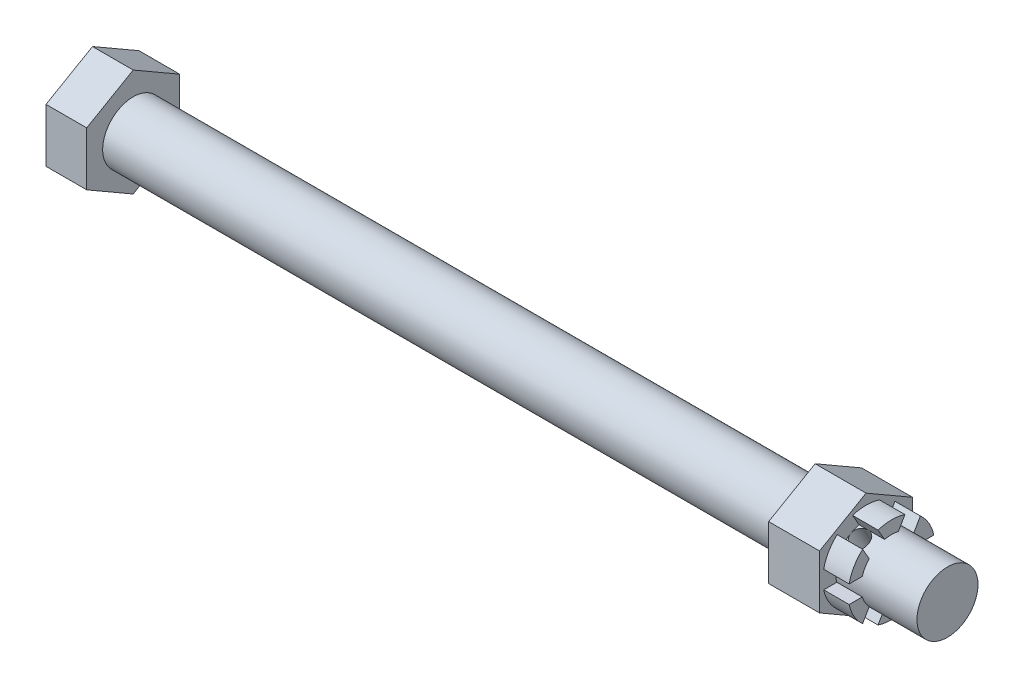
ISO-10303-21;
HEADER;
FILE_DESCRIPTION(('STEP AP214'),'2;1');
FILE_NAME('part.step','',(''),(''),'','','');
FILE_SCHEMA(('AUTOMOTIVE_DESIGN { 1 0 10303 214 1 1 1 1 }'));
ENDSEC;
DATA;
#1=APPLICATION_CONTEXT('core data for automotive mechanical design processes');
#2=APPLICATION_PROTOCOL_DEFINITION('international standard','automotive_design',2000,#1);
#3=PRODUCT_CONTEXT('',#1,'mechanical');
#4=PRODUCT('Part','Part','',(#3));
#5=PRODUCT_RELATED_PRODUCT_CATEGORY('part','',(#4));
#6=PRODUCT_DEFINITION_FORMATION('','',#4);
#7=PRODUCT_DEFINITION_CONTEXT('part definition',#1,'design');
#8=PRODUCT_DEFINITION('design','',#6,#7);
#9=PRODUCT_DEFINITION_SHAPE('','',#8);
#10=(LENGTH_UNIT() NAMED_UNIT(*) SI_UNIT(.MILLI.,.METRE.));
#11=(NAMED_UNIT(*) PLANE_ANGLE_UNIT() SI_UNIT($,.RADIAN.));
#12=(NAMED_UNIT(*) SI_UNIT($,.STERADIAN.) SOLID_ANGLE_UNIT());
#13=UNCERTAINTY_MEASURE_WITH_UNIT(LENGTH_MEASURE(1.E-05),#10,'distance_accuracy_value','');
#14=(GEOMETRIC_REPRESENTATION_CONTEXT(3) GLOBAL_UNCERTAINTY_ASSIGNED_CONTEXT((#13)) GLOBAL_UNIT_ASSIGNED_CONTEXT((#10,
#11,#12)) REPRESENTATION_CONTEXT('',''));
#15=CARTESIAN_POINT('',(0.,0.,0.));
#16=DIRECTION('',(0.,0.,1.));
#17=DIRECTION('',(1.,0.,0.));
#18=AXIS2_PLACEMENT_3D('',#15,#16,#17);
#19=CARTESIAN_POINT('',(85.1881407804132,0.,0.));
#20=DIRECTION('',(1.,0.,0.));
#21=DIRECTION('',(0.,0.,-1.));
#22=AXIS2_PLACEMENT_3D('',#19,#20,#21);
#23=CYLINDRICAL_SURFACE('',#22,6.);
#24=CARTESIAN_POINT('',(51.3771231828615,-5.19615242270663,-3.));
#25=CARTESIAN_POINT('',(51.3771246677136,-5.14808888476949,-3.0832464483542));
#26=CARTESIAN_POINT('',(51.3850695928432,-5.09799974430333,-3.16534087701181));
#27=CARTESIAN_POINT('',(51.4165689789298,-4.99539830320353,-3.32490687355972));
#28=CARTESIAN_POINT('',(51.4401288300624,-4.94288517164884,-3.40237683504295));
#29=CARTESIAN_POINT('',(51.5020101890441,-4.83745729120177,-3.55067294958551));
#30=CARTESIAN_POINT('',(51.5403106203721,-4.7845432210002,-3.62150840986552));
#31=CARTESIAN_POINT('',(51.6305016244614,-4.68031206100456,-3.75524660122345));
#32=CARTESIAN_POINT('',(51.6823937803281,-4.62899515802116,-3.81814840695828));
#33=CARTESIAN_POINT('',(51.7997881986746,-4.52886281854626,-3.93643998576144));
#34=CARTESIAN_POINT('',(51.8655935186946,-4.4801398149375,-3.99160723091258));
#35=CARTESIAN_POINT('',(52.0082999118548,-4.38885125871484,-4.09177061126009));
#36=CARTESIAN_POINT('',(52.0852027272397,-4.34628667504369,-4.13676514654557));
#37=CARTESIAN_POINT('',(52.2499128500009,-4.26867865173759,-4.21681936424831));
#38=CARTESIAN_POINT('',(52.3379157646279,-4.233812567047,-4.25164975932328));
#39=CARTESIAN_POINT('',(52.5211092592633,-4.17486009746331,-4.30955483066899));
#40=CARTESIAN_POINT('',(52.6162982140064,-4.15077128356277,-4.33263215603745));
#41=CARTESIAN_POINT('',(52.8084878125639,-4.11544981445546,-4.36619471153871));
#42=CARTESIAN_POINT('',(52.9053728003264,-4.10389203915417,-4.37699874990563));
#43=CARTESIAN_POINT('',(53.1004079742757,-4.09329952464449,-4.3869073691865));
#44=CARTESIAN_POINT('',(53.1985578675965,-4.09426193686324,-4.38601461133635));
#45=CARTESIAN_POINT('',(53.3898079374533,-4.10838736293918,-4.3727835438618));
#46=CARTESIAN_POINT('',(53.4829664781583,-4.12113546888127,-4.36083445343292));
#47=CARTESIAN_POINT('',(53.6650939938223,-4.15743159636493,-4.32624373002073));
#48=CARTESIAN_POINT('',(53.7540625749,-4.18098063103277,-4.30360109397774));
#49=CARTESIAN_POINT('',(53.9266391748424,-4.23787066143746,-4.24759431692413));
#50=CARTESIAN_POINT('',(54.0101617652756,-4.27133581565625,-4.21409369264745));
#51=CARTESIAN_POINT('',(54.1685299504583,-4.34613574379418,-4.13690528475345));
#52=CARTESIAN_POINT('',(54.2433735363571,-4.38747233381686,-4.0932151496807));
#53=CARTESIAN_POINT('',(54.3853537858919,-4.4777683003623,-3.99427608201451));
#54=CARTESIAN_POINT('',(54.4520712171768,-4.52696365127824,-3.93863991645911));
#55=CARTESIAN_POINT('',(54.5724486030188,-4.62937031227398,-3.81774766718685));
#56=CARTESIAN_POINT('',(54.6261078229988,-4.68258184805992,-3.75249104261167));
#57=CARTESIAN_POINT('',(54.7190815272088,-4.7909912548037,-3.61306479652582));
#58=CARTESIAN_POINT('',(54.7583074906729,-4.84619917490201,-3.53884376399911));
#59=CARTESIAN_POINT('',(54.8206283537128,-4.95593334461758,-3.38345340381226));
#60=CARTESIAN_POINT('',(54.8437274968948,-5.01045976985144,-3.3022859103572));
#61=CARTESIAN_POINT('',(54.8724514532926,-5.11487007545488,-3.13803293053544));
#62=CARTESIAN_POINT('',(54.8786448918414,-5.16484884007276,-3.05510704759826));
#63=CARTESIAN_POINT('',(54.8749693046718,-5.2605558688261,-2.88719357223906));
#64=CARTESIAN_POINT('',(54.8651022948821,-5.30628466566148,-2.80220623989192));
#65=CARTESIAN_POINT('',(54.8300475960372,-5.39143759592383,-2.63458895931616));
#66=CARTESIAN_POINT('',(54.8051882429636,-5.43097458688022,-2.55194716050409));
#67=CARTESIAN_POINT('',(54.7412459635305,-5.50430440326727,-2.38967943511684));
#68=CARTESIAN_POINT('',(54.7021613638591,-5.5380965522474,-2.31005386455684));
#69=CARTESIAN_POINT('',(54.6098978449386,-5.6004770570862,-2.1544933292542));
#70=CARTESIAN_POINT('',(54.5564243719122,-5.62893273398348,-2.07868007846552));
#71=CARTESIAN_POINT('',(54.4372620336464,-5.67990505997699,-1.93506975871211));
#72=CARTESIAN_POINT('',(54.3715702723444,-5.70242029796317,-1.86727459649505));
#73=CARTESIAN_POINT('',(54.2271678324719,-5.74262957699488,-1.73977945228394));
#74=CARTESIAN_POINT('',(54.1480888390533,-5.76013247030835,-1.68043547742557));
#75=CARTESIAN_POINT('',(53.9806462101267,-5.78985741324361,-1.57498057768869));
#76=CARTESIAN_POINT('',(53.8922828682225,-5.80207962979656,-1.52886923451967));
#77=CARTESIAN_POINT('',(53.7091141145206,-5.8217740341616,-1.45207456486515));
#78=CARTESIAN_POINT('',(53.6143441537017,-5.82927031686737,-1.42131314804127));
#79=CARTESIAN_POINT('',(53.4207276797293,-5.84004614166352,-1.37637400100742));
#80=CARTESIAN_POINT('',(53.3218824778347,-5.84332702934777,-1.36219097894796));
#81=CARTESIAN_POINT('',(53.1271006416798,-5.84584083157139,-1.35135927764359));
#82=CARTESIAN_POINT('',(53.0312026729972,-5.84522800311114,-1.35404236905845));
#83=CARTESIAN_POINT('',(52.8412802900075,-5.84027488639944,-1.3752473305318));
#84=CARTESIAN_POINT('',(52.7472558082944,-5.83593473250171,-1.3937686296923));
#85=CARTESIAN_POINT('',(52.5647569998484,-5.82334169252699,-1.44546956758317));
#86=CARTESIAN_POINT('',(52.4762327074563,-5.8151327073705,-1.47848446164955));
#87=CARTESIAN_POINT('',(52.3058559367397,-5.79440762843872,-1.55772587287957));
#88=CARTESIAN_POINT('',(52.2240046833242,-5.78189074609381,-1.60395480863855));
#89=CARTESIAN_POINT('',(52.0662311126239,-5.75152912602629,-1.70968804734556));
#90=CARTESIAN_POINT('',(51.9906124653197,-5.73351482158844,-1.76959680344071));
#91=CARTESIAN_POINT('',(51.8504535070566,-5.69177783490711,-1.89955673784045));
#92=CARTESIAN_POINT('',(51.7859160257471,-5.6680536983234,-1.96961049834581));
#93=CARTESIAN_POINT('',(51.6680136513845,-5.6137361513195,-2.1195485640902));
#94=CARTESIAN_POINT('',(51.6149990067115,-5.58297397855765,-2.19964785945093));
#95=CARTESIAN_POINT('',(51.5240479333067,-5.5148035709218,-2.36536402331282));
#96=CARTESIAN_POINT('',(51.4861037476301,-5.47739876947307,-2.4509780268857));
#97=CARTESIAN_POINT('',(51.4301822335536,-5.40119381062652,-2.61423246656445));
#98=CARTESIAN_POINT('',(51.4103369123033,-5.36311747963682,-2.69157525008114));
#99=CARTESIAN_POINT('',(51.3838076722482,-5.2826462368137,-2.84626863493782));
#100=CARTESIAN_POINT('',(51.3771218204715,-5.24025196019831,-2.92361923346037));
#101=CARTESIAN_POINT('',(51.3771231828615,-5.19615242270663,-3.));
#102=B_SPLINE_CURVE_WITH_KNOTS('',3,(#24,#25,#26,#27,#28,#29,#30,#31,#32,#33,#34,#35,#36,#37,
#38,#39,#40,#41,#42,#43,#44,#45,#46,#47,#48,#49,#50,#51,#52,#53,#54,#55,#56,#57,#58,#59,#60,#61,
#62,#63,#64,#65,#66,#67,#68,#69,#70,#71,#72,#73,#74,#75,#76,#77,#78,#79,#80,#81,#82,#83,#84,#85,
#86,#87,#88,#89,#90,#91,#92,#93,#94,#95,#96,#97,#98,#99,#100,#101),.UNSPECIFIED.,.T.,.F.,(4,2,2,
2,2,2,2,2,2,2,2,2,2,2,2,2,2,2,2,2,2,2,2,2,2,2,2,2,2,2,2,2,2,2,2,2,2,2,4),(0.,0.288052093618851,
0.576203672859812,0.863944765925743,1.15171938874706,1.44656421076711,1.74145537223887,
2.04255951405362,2.34359575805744,2.63661948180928,2.92957653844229,3.21259753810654,
3.49564509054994,3.78239825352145,4.06921765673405,4.36732499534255,4.66544909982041,
4.96537230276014,5.26521655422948,5.55484346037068,5.84443401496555,6.12790175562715,
6.41140285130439,6.70121883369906,6.99110359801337,7.29089914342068,7.59068521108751,
7.8889302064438,8.18707997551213,8.47349366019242,8.75989702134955,9.04312596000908,
9.32640677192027,9.61950228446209,9.91267252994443,10.2137891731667,10.5147506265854,
10.779084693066,11.0433799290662),.UNSPECIFIED.);
#103=CARTESIAN_POINT('',(51.3771231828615,-5.19615242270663,-3.));
#104=VERTEX_POINT('',#103);
#105=CARTESIAN_POINT('',(53.1271231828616,-4.09522383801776,-4.38510452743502));
#106=VERTEX_POINT('',#105);
#107=EDGE_CURVE('E11',#104,#106,#102,.T.);
#108=ORIENTED_EDGE('',*,*,#107,.F.);
#109=CARTESIAN_POINT('',(51.3771231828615,0.,0.));
#110=DIRECTION('',(-1.,0.,0.));
#111=DIRECTION('',(0.,0.,-1.));
#112=AXIS2_PLACEMENT_3D('',#109,#110,#111);
#113=CIRCLE('',#112,6.);
#114=CARTESIAN_POINT('',(51.3771231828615,-4.09522383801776,-4.38510452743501));
#115=VERTEX_POINT('',#114);
#116=EDGE_CURVE('E337',#115,#104,#113,.T.);
#117=ORIENTED_EDGE('',*,*,#116,.F.);
#118=DIRECTION('',(1.,0.,0.));
#119=VECTOR('',#118,1.);
#120=CARTESIAN_POINT('',(51.3771231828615,-4.09522383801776,-4.38510452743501));
#121=LINE('',#120,#119);
#122=EDGE_CURVE('E351',#115,#106,#121,.T.);
#123=ORIENTED_EDGE('',*,*,#122,.T.);
#124=EDGE_LOOP('',(#108,#117,#123));
#125=FACE_BOUND('',#124,.T.);
#126=ADVANCED_FACE('F32',(#125),#23,.T.);
#127=CARTESIAN_POINT('',(53.1271231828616,-5.84522383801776,-1.35401561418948));
#128=VERTEX_POINT('',#127);
#129=EDGE_CURVE('E45',#106,#128,#102,.T.);
#130=ORIENTED_EDGE('',*,*,#129,.F.);
#131=CARTESIAN_POINT('',(56.3771231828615,-4.09522383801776,-4.38510452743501));
#132=VERTEX_POINT('',#131);
#133=EDGE_CURVE('E354',#106,#132,#121,.T.);
#134=ORIENTED_EDGE('',*,*,#133,.T.);
#135=CARTESIAN_POINT('',(56.3771231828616,0.,0.));
#136=DIRECTION('',(1.,0.,0.));
#137=DIRECTION('',(0.,0.,-1.));
#138=AXIS2_PLACEMENT_3D('',#135,#136,#137);
#139=CIRCLE('',#138,6.);
#140=CARTESIAN_POINT('',(56.3771231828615,-1.75,-5.7391201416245));
#141=VERTEX_POINT('',#140);
#142=EDGE_CURVE('E454',#132,#141,#139,.T.);
#143=ORIENTED_EDGE('',*,*,#142,.T.);
#144=DIRECTION('',(1.,0.,0.));
#145=VECTOR('',#144,1.);
#146=CARTESIAN_POINT('',(51.3771231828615,-1.75,-5.7391201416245));
#147=LINE('',#146,#145);
#148=CARTESIAN_POINT('',(51.3771231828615,-1.75,-5.7391201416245));
#149=VERTEX_POINT('',#148);
#150=EDGE_CURVE('E722',#149,#141,#147,.T.);
#151=ORIENTED_EDGE('',*,*,#150,.F.);
#152=CARTESIAN_POINT('',(51.3771231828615,0.,0.));
#153=DIRECTION('',(-1.,0.,0.));
#154=DIRECTION('',(0.,0.,-1.));
#155=AXIS2_PLACEMENT_3D('',#152,#153,#154);
#156=CIRCLE('',#155,6.);
#157=CARTESIAN_POINT('',(51.3771231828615,1.75,-5.7391201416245));
#158=VERTEX_POINT('',#157);
#159=EDGE_CURVE('E726',#158,#149,#156,.T.);
#160=ORIENTED_EDGE('',*,*,#159,.F.);
#161=DIRECTION('',(1.,0.,0.));
#162=VECTOR('',#161,1.);
#163=CARTESIAN_POINT('',(51.3771231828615,1.75,-5.7391201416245));
#164=LINE('',#163,#162);
#165=CARTESIAN_POINT('',(56.3771231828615,1.75,-5.7391201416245));
#166=VERTEX_POINT('',#165);
#167=EDGE_CURVE('E719',#158,#166,#164,.T.);
#168=ORIENTED_EDGE('',*,*,#167,.T.);
#169=CARTESIAN_POINT('',(56.3771231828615,4.09522383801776,-4.38510452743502));
#170=VERTEX_POINT('',#169);
#171=EDGE_CURVE('E458',#166,#170,#139,.T.);
#172=ORIENTED_EDGE('',*,*,#171,.T.);
#173=DIRECTION('',(1.,0.,0.));
#174=VECTOR('',#173,1.);
#175=CARTESIAN_POINT('',(51.3771231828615,4.09522383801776,-4.38510452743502));
#176=LINE('',#175,#174);
#177=CARTESIAN_POINT('',(51.3771231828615,4.09522383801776,-4.38510452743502));
#178=VERTEX_POINT('',#177);
#179=EDGE_CURVE('E752',#178,#170,#176,.T.);
#180=ORIENTED_EDGE('',*,*,#179,.F.);
#181=CARTESIAN_POINT('',(51.3771231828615,0.,0.));
#182=DIRECTION('',(-1.,0.,0.));
#183=DIRECTION('',(0.,0.,-1.));
#184=AXIS2_PLACEMENT_3D('',#181,#182,#183);
#185=CIRCLE('',#184,6.);
#186=CARTESIAN_POINT('',(51.3771231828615,5.84522383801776,-1.35401561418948));
#187=VERTEX_POINT('',#186);
#188=EDGE_CURVE('E765',#187,#178,#185,.T.);
#189=ORIENTED_EDGE('',*,*,#188,.F.);
#190=DIRECTION('',(1.,0.,0.));
#191=VECTOR('',#190,1.);
#192=CARTESIAN_POINT('',(51.3771231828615,5.84522383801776,-1.35401561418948));
#193=LINE('',#192,#191);
#194=CARTESIAN_POINT('',(56.3771231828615,5.84522383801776,-1.35401561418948));
#195=VERTEX_POINT('',#194);
#196=EDGE_CURVE('E708',#187,#195,#193,.T.);
#197=ORIENTED_EDGE('',*,*,#196,.T.);
#198=CARTESIAN_POINT('',(56.3771231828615,5.84522383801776,1.35401561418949));
#199=VERTEX_POINT('',#198);
#200=EDGE_CURVE('E459',#195,#199,#139,.T.);
#201=ORIENTED_EDGE('',*,*,#200,.T.);
#202=DIRECTION('',(1.,0.,0.));
#203=VECTOR('',#202,1.);
#204=CARTESIAN_POINT('',(51.3771231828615,5.84522383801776,1.35401561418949));
#205=LINE('',#204,#203);
#206=CARTESIAN_POINT('',(53.1271231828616,5.84522383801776,1.35401561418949));
#207=VERTEX_POINT('',#206);
#208=EDGE_CURVE('E319',#207,#199,#205,.T.);
#209=ORIENTED_EDGE('',*,*,#208,.F.);
#210=CARTESIAN_POINT('',(51.3771231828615,5.19615242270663,3.));
#211=CARTESIAN_POINT('',(51.3771246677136,5.14808888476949,3.0832464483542));
#212=CARTESIAN_POINT('',(51.3850695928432,5.09799974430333,3.16534087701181));
#213=CARTESIAN_POINT('',(51.4165689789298,4.99539830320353,3.32490687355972));
#214=CARTESIAN_POINT('',(51.4401288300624,4.94288517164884,3.40237683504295));
#215=CARTESIAN_POINT('',(51.5020101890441,4.83745729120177,3.5506729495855));
#216=CARTESIAN_POINT('',(51.5403106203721,4.7845432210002,3.62150840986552));
#217=CARTESIAN_POINT('',(51.6305016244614,4.68031206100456,3.75524660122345));
#218=CARTESIAN_POINT('',(51.6823937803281,4.62899515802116,3.81814840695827));
#219=CARTESIAN_POINT('',(51.7997881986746,4.52886281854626,3.93643998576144));
#220=CARTESIAN_POINT('',(51.8655935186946,4.4801398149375,3.99160723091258));
#221=CARTESIAN_POINT('',(52.0082999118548,4.38885125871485,4.09177061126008));
#222=CARTESIAN_POINT('',(52.0852027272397,4.3462866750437,4.13676514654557));
#223=CARTESIAN_POINT('',(52.2499128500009,4.26867865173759,4.2168193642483));
#224=CARTESIAN_POINT('',(52.3379157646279,4.23381256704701,4.25164975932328));
#225=CARTESIAN_POINT('',(52.5211092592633,4.17486009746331,4.30955483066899));
#226=CARTESIAN_POINT('',(52.6162982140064,4.15077128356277,4.33263215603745));
#227=CARTESIAN_POINT('',(52.8084878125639,4.11544981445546,4.36619471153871));
#228=CARTESIAN_POINT('',(52.9053728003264,4.10389203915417,4.37699874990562));
#229=CARTESIAN_POINT('',(53.1004079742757,4.09329952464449,4.3869073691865));
#230=CARTESIAN_POINT('',(53.1985578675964,4.09426193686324,4.38601461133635));
#231=CARTESIAN_POINT('',(53.3898079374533,4.10838736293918,4.3727835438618));
#232=CARTESIAN_POINT('',(53.4829664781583,4.12113546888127,4.36083445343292));
#233=CARTESIAN_POINT('',(53.6650939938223,4.15743159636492,4.32624373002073));
#234=CARTESIAN_POINT('',(53.7540625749,4.18098063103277,4.30360109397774));
#235=CARTESIAN_POINT('',(53.9266391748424,4.23787066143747,4.24759431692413));
#236=CARTESIAN_POINT('',(54.0101617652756,4.27133581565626,4.21409369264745));
#237=CARTESIAN_POINT('',(54.1685299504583,4.34613574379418,4.13690528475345));
#238=CARTESIAN_POINT('',(54.2433735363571,4.38747233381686,4.0932151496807));
#239=CARTESIAN_POINT('',(54.3853537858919,4.4777683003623,3.99427608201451));
#240=CARTESIAN_POINT('',(54.4520712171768,4.52696365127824,3.93863991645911));
#241=CARTESIAN_POINT('',(54.5724486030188,4.62937031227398,3.81774766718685));
#242=CARTESIAN_POINT('',(54.6261078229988,4.68258184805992,3.75249104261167));
#243=CARTESIAN_POINT('',(54.7190815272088,4.79099125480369,3.61306479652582));
#244=CARTESIAN_POINT('',(54.7583074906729,4.84619917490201,3.53884376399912));
#245=CARTESIAN_POINT('',(54.8206283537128,4.95593334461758,3.38345340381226));
#246=CARTESIAN_POINT('',(54.8437274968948,5.01045976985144,3.3022859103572));
#247=CARTESIAN_POINT('',(54.8724514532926,5.11487007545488,3.13803293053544));
#248=CARTESIAN_POINT('',(54.8786448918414,5.16484884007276,3.05510704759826));
#249=CARTESIAN_POINT('',(54.8749693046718,5.2605558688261,2.88719357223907));
#250=CARTESIAN_POINT('',(54.8651022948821,5.30628466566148,2.80220623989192));
#251=CARTESIAN_POINT('',(54.8300475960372,5.39143759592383,2.63458895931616));
#252=CARTESIAN_POINT('',(54.8051882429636,5.43097458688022,2.55194716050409));
#253=CARTESIAN_POINT('',(54.7412459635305,5.50430440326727,2.38967943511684));
#254=CARTESIAN_POINT('',(54.7021613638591,5.5380965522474,2.31005386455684));
#255=CARTESIAN_POINT('',(54.6098978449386,5.6004770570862,2.1544933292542));
#256=CARTESIAN_POINT('',(54.5564243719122,5.62893273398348,2.07868007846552));
#257=CARTESIAN_POINT('',(54.4372620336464,5.67990505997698,1.93506975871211));
#258=CARTESIAN_POINT('',(54.3715702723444,5.70242029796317,1.86727459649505));
#259=CARTESIAN_POINT('',(54.2271678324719,5.74262957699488,1.73977945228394));
#260=CARTESIAN_POINT('',(54.1480888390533,5.76013247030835,1.68043547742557));
#261=CARTESIAN_POINT('',(53.9806462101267,5.78985741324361,1.57498057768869));
#262=CARTESIAN_POINT('',(53.8922828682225,5.80207962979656,1.52886923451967));
#263=CARTESIAN_POINT('',(53.7091141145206,5.8217740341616,1.45207456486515));
#264=CARTESIAN_POINT('',(53.6143441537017,5.82927031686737,1.42131314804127));
#265=CARTESIAN_POINT('',(53.4207276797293,5.84004614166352,1.37637400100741));
#266=CARTESIAN_POINT('',(53.3218824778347,5.84332702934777,1.36219097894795));
#267=CARTESIAN_POINT('',(53.1271006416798,5.84584083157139,1.35135927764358));
#268=CARTESIAN_POINT('',(53.0312026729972,5.84522800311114,1.35404236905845));
#269=CARTESIAN_POINT('',(52.8412802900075,5.84027488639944,1.3752473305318));
#270=CARTESIAN_POINT('',(52.7472558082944,5.83593473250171,1.3937686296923));
#271=CARTESIAN_POINT('',(52.5647569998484,5.82334169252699,1.44546956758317));
#272=CARTESIAN_POINT('',(52.4762327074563,5.8151327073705,1.47848446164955));
#273=CARTESIAN_POINT('',(52.3058559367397,5.79440762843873,1.55772587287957));
#274=CARTESIAN_POINT('',(52.2240046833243,5.78189074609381,1.60395480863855));
#275=CARTESIAN_POINT('',(52.0662311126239,5.75152912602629,1.70968804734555));
#276=CARTESIAN_POINT('',(51.9906124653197,5.73351482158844,1.7695968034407));
#277=CARTESIAN_POINT('',(51.8504535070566,5.69177783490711,1.89955673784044));
#278=CARTESIAN_POINT('',(51.7859160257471,5.66805369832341,1.9696104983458));
#279=CARTESIAN_POINT('',(51.6680136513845,5.6137361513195,2.11954856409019));
#280=CARTESIAN_POINT('',(51.6149990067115,5.58297397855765,2.19964785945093));
#281=CARTESIAN_POINT('',(51.5240479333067,5.5148035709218,2.36536402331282));
#282=CARTESIAN_POINT('',(51.4861037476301,5.47739876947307,2.4509780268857));
#283=CARTESIAN_POINT('',(51.4301822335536,5.40119381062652,2.61423246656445));
#284=CARTESIAN_POINT('',(51.4103369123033,5.36311747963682,2.69157525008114));
#285=CARTESIAN_POINT('',(51.3838076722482,5.2826462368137,2.84626863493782));
#286=CARTESIAN_POINT('',(51.3771218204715,5.24025196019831,2.92361923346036));
#287=CARTESIAN_POINT('',(51.3771231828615,5.19615242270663,3.));
#288=B_SPLINE_CURVE_WITH_KNOTS('',3,(#210,#211,#212,#213,#214,#215,#216,#217,#218,#219,#220,
#221,#222,#223,#224,#225,#226,#227,#228,#229,#230,#231,#232,#233,#234,#235,#236,#237,#238,#239,
#240,#241,#242,#243,#244,#245,#246,#247,#248,#249,#250,#251,#252,#253,#254,#255,#256,#257,#258,
#259,#260,#261,#262,#263,#264,#265,#266,#267,#268,#269,#270,#271,#272,#273,#274,#275,#276,#277,
#278,#279,#280,#281,#282,#283,#284,#285,#286,#287),.UNSPECIFIED.,.T.,.F.,(4,2,2,2,2,2,2,2,2,2,2,
2,2,2,2,2,2,2,2,2,2,2,2,2,2,2,2,2,2,2,2,2,2,2,2,2,2,2,4),(0.,0.288052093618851,0.57620367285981,
0.863944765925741,1.15171938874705,1.44656421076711,1.74145537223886,2.04255951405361,
2.34359575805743,2.63661948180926,2.92957653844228,3.21259753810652,3.49564509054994,
3.78239825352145,4.06921765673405,4.36732499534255,4.66544909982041,4.96537230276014,
5.26521655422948,5.55484346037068,5.84443401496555,6.12790175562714,6.41140285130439,
6.70121883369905,6.99110359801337,7.29089914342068,7.5906852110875,7.88893020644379,
8.18707997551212,8.47349366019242,8.75989702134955,9.04312596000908,9.32640677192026,
9.61950228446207,9.91267252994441,10.2137891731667,10.5147506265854,10.779084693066,
11.0433799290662),.UNSPECIFIED.);
#289=CARTESIAN_POINT('',(53.1271231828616,4.09522383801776,4.38510452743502));
#290=VERTEX_POINT('',#289);
#291=EDGE_CURVE('E58',#290,#207,#288,.T.);
#292=ORIENTED_EDGE('',*,*,#291,.F.);
#293=DIRECTION('',(1.,0.,0.));
#294=VECTOR('',#293,1.);
#295=CARTESIAN_POINT('',(51.3771231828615,4.09522383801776,4.38510452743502));
#296=LINE('',#295,#294);
#297=CARTESIAN_POINT('',(56.3771231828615,4.09522383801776,4.38510452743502));
#298=VERTEX_POINT('',#297);
#299=EDGE_CURVE('E322',#290,#298,#296,.T.);
#300=ORIENTED_EDGE('',*,*,#299,.T.);
#301=CARTESIAN_POINT('',(56.3771231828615,1.75,5.7391201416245));
#302=VERTEX_POINT('',#301);
#303=EDGE_CURVE('E460',#298,#302,#139,.T.);
#304=ORIENTED_EDGE('',*,*,#303,.T.);
#305=DIRECTION('',(1.,0.,0.));
#306=VECTOR('',#305,1.);
#307=CARTESIAN_POINT('',(51.3771231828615,1.75,5.7391201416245));
#308=LINE('',#307,#306);
#309=CARTESIAN_POINT('',(51.3771231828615,1.75,5.7391201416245));
#310=VERTEX_POINT('',#309);
#311=EDGE_CURVE('E661',#310,#302,#308,.T.);
#312=ORIENTED_EDGE('',*,*,#311,.F.);
#313=CARTESIAN_POINT('',(51.3771231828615,0.,0.));
#314=DIRECTION('',(-1.,0.,0.));
#315=DIRECTION('',(0.,0.,-1.));
#316=AXIS2_PLACEMENT_3D('',#313,#314,#315);
#317=CIRCLE('',#316,6.);
#318=CARTESIAN_POINT('',(51.3771231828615,-1.75,5.7391201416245));
#319=VERTEX_POINT('',#318);
#320=EDGE_CURVE('E655',#319,#310,#317,.T.);
#321=ORIENTED_EDGE('',*,*,#320,.F.);
#322=DIRECTION('',(1.,0.,0.));
#323=VECTOR('',#322,1.);
#324=CARTESIAN_POINT('',(51.3771231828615,-1.75,5.7391201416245));
#325=LINE('',#324,#323);
#326=CARTESIAN_POINT('',(56.3771231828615,-1.75,5.7391201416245));
#327=VERTEX_POINT('',#326);
#328=EDGE_CURVE('E664',#319,#327,#325,.T.);
#329=ORIENTED_EDGE('',*,*,#328,.T.);
#330=CARTESIAN_POINT('',(56.3771231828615,-4.09522383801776,4.38510452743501));
#331=VERTEX_POINT('',#330);
#332=EDGE_CURVE('E684',#327,#331,#139,.T.);
#333=ORIENTED_EDGE('',*,*,#332,.T.);
#334=DIRECTION('',(1.,0.,0.));
#335=VECTOR('',#334,1.);
#336=CARTESIAN_POINT('',(51.3771231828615,-4.09522383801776,4.38510452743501));
#337=LINE('',#336,#335);
#338=CARTESIAN_POINT('',(51.3771231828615,-4.09522383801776,4.38510452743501));
#339=VERTEX_POINT('',#338);
#340=EDGE_CURVE('E712',#339,#331,#337,.T.);
#341=ORIENTED_EDGE('',*,*,#340,.F.);
#342=CARTESIAN_POINT('',(51.3771231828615,0.,0.));
#343=DIRECTION('',(-1.,0.,0.));
#344=DIRECTION('',(0.,0.,-1.));
#345=AXIS2_PLACEMENT_3D('',#342,#343,#344);
#346=CIRCLE('',#345,6.);
#347=CARTESIAN_POINT('',(51.3771231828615,-5.84522383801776,1.35401561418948));
#348=VERTEX_POINT('',#347);
#349=EDGE_CURVE('E745',#348,#339,#346,.T.);
#350=ORIENTED_EDGE('',*,*,#349,.F.);
#351=DIRECTION('',(1.,0.,0.));
#352=VECTOR('',#351,1.);
#353=CARTESIAN_POINT('',(51.3771231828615,-5.84522383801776,1.35401561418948));
#354=LINE('',#353,#352);
#355=CARTESIAN_POINT('',(56.3771231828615,-5.84522383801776,1.35401561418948));
#356=VERTEX_POINT('',#355);
#357=EDGE_CURVE('E736',#348,#356,#354,.T.);
#358=ORIENTED_EDGE('',*,*,#357,.T.);
#359=CARTESIAN_POINT('',(56.3771231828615,-5.84522383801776,-1.35401561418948));
#360=VERTEX_POINT('',#359);
#361=EDGE_CURVE('E453',#356,#360,#139,.T.);
#362=ORIENTED_EDGE('',*,*,#361,.T.);
#363=DIRECTION('',(1.,0.,0.));
#364=VECTOR('',#363,1.);
#365=CARTESIAN_POINT('',(51.3771231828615,-5.84522383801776,-1.35401561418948));
#366=LINE('',#365,#364);
#367=EDGE_CURVE('E350',#128,#360,#366,.T.);
#368=ORIENTED_EDGE('',*,*,#367,.F.);
#369=EDGE_LOOP('',(#130,#134,#143,#151,#160,#168,#172,#180,#189,#197,#201,#209,#292,#300,#304,
#312,#321,#329,#333,#341,#350,#358,#362,#368));
#370=FACE_BOUND('',#369,.T.);
#371=CARTESIAN_POINT('',(67.3771231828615,0.,0.));
#372=DIRECTION('',(1.,0.,0.));
#373=DIRECTION('',(0.,0.,-1.));
#374=AXIS2_PLACEMENT_3D('',#371,#372,#373);
#375=CIRCLE('',#374,6.);
#376=CARTESIAN_POINT('',(67.3771231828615,0.,-6.));
#377=VERTEX_POINT('',#376);
#378=EDGE_CURVE('E450',#377,#377,#375,.T.);
#379=ORIENTED_EDGE('',*,*,#378,.F.);
#380=EDGE_LOOP('',(#379));
#381=FACE_BOUND('',#380,.T.);
#382=ADVANCED_FACE('F596',(#370,#381),#23,.T.);
#383=CARTESIAN_POINT('',(51.3771231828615,5.19615242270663,3.));
#384=VERTEX_POINT('',#383);
#385=EDGE_CURVE('E286',#384,#290,#288,.T.);
#386=ORIENTED_EDGE('',*,*,#385,.F.);
#387=CARTESIAN_POINT('',(51.3771231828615,0.,0.));
#388=DIRECTION('',(-1.,0.,0.));
#389=DIRECTION('',(0.,0.,-1.));
#390=AXIS2_PLACEMENT_3D('',#387,#388,#389);
#391=CIRCLE('',#390,6.);
#392=CARTESIAN_POINT('',(51.3771231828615,4.09522383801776,4.38510452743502));
#393=VERTEX_POINT('',#392);
#394=EDGE_CURVE('E297',#393,#384,#391,.T.);
#395=ORIENTED_EDGE('',*,*,#394,.F.);
#396=EDGE_CURVE('E299',#393,#290,#296,.T.);
#397=ORIENTED_EDGE('',*,*,#396,.T.);
#398=EDGE_LOOP('',(#386,#395,#397));
#399=FACE_BOUND('',#398,.T.);
#400=ADVANCED_FACE('F295',(#399),#23,.T.);
#401=EDGE_CURVE('E36',#128,#104,#102,.T.);
#402=ORIENTED_EDGE('',*,*,#401,.F.);
#403=CARTESIAN_POINT('',(51.3771231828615,-5.84522383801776,-1.35401561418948));
#404=VERTEX_POINT('',#403);
#405=EDGE_CURVE('E347',#404,#128,#366,.T.);
#406=ORIENTED_EDGE('',*,*,#405,.F.);
#407=EDGE_CURVE('E336',#104,#404,#113,.T.);
#408=ORIENTED_EDGE('',*,*,#407,.F.);
#409=EDGE_LOOP('',(#402,#406,#408));
#410=FACE_BOUND('',#409,.T.);
#411=ADVANCED_FACE('F594',(#410),#23,.T.);
#412=CARTESIAN_POINT('',(56.3771231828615,8.5,0.));
#413=DIRECTION('',(1.,0.,0.));
#414=DIRECTION('',(0.,0.,-1.));
#415=AXIS2_PLACEMENT_3D('',#412,#413,#414);
#416=PLANE('',#415);
#417=DIRECTION('',(0.,-0.866025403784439,0.5));
#418=VECTOR('',#417,1.);
#419=CARTESIAN_POINT('',(56.3771231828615,8.07851476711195,-2.64340673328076));
#420=LINE('',#419,#418);
#421=CARTESIAN_POINT('',(56.3771231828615,8.07851476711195,-2.64340673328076));
#422=VERTEX_POINT('',#421);
#423=EDGE_CURVE('E704',#422,#195,#420,.T.);
#424=ORIENTED_EDGE('',*,*,#423,.F.);
#425=CARTESIAN_POINT('',(56.3771231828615,0.,0.));
#426=DIRECTION('',(1.,0.,0.));
#427=DIRECTION('',(0.,0.,-1.));
#428=AXIS2_PLACEMENT_3D('',#425,#426,#427);
#429=CIRCLE('',#428,8.5);
#430=CARTESIAN_POINT('',(56.3771231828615,8.07851476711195,2.64340673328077));
#431=VERTEX_POINT('',#430);
#432=EDGE_CURVE('E466',#422,#431,#429,.T.);
#433=ORIENTED_EDGE('',*,*,#432,.T.);
#434=DIRECTION('',(0.,0.866025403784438,0.5));
#435=VECTOR('',#434,1.);
#436=CARTESIAN_POINT('',(56.3771231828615,8.07851476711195,2.64340673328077));
#437=LINE('',#436,#435);
#438=EDGE_CURVE('E660',#199,#431,#437,.T.);
#439=ORIENTED_EDGE('',*,*,#438,.F.);
#440=ORIENTED_EDGE('',*,*,#200,.F.);
#441=EDGE_LOOP('',(#424,#433,#439,#440));
#442=FACE_BOUND('',#441,.T.);
#443=ADVANCED_FACE('F701',(#442),#416,.T.);
#444=CARTESIAN_POINT('',(85.1881407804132,0.,0.));
#445=DIRECTION('',(1.,0.,0.));
#446=DIRECTION('',(0.,0.,-1.));
#447=AXIS2_PLACEMENT_3D('',#444,#445,#446);
#448=CYLINDRICAL_SURFACE('',#447,8.5);
#449=DIRECTION('',(1.,0.,0.));
#450=VECTOR('',#449,1.);
#451=CARTESIAN_POINT('',(51.3771231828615,8.07851476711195,-2.64340673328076));
#452=LINE('',#451,#450);
#453=CARTESIAN_POINT('',(51.3771231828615,8.07851476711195,-2.64340673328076));
#454=VERTEX_POINT('',#453);
#455=EDGE_CURVE('E758',#454,#422,#452,.T.);
#456=ORIENTED_EDGE('',*,*,#455,.F.);
#457=CARTESIAN_POINT('',(51.3771231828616,0.,0.));
#458=DIRECTION('',(1.,0.,0.));
#459=DIRECTION('',(0.,0.,-1.));
#460=AXIS2_PLACEMENT_3D('',#457,#458,#459);
#461=CIRCLE('',#460,8.5);
#462=CARTESIAN_POINT('',(51.3771231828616,8.07851476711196,2.64340673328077));
#463=VERTEX_POINT('',#462);
#464=EDGE_CURVE('E472',#454,#463,#461,.T.);
#465=ORIENTED_EDGE('',*,*,#464,.T.);
#466=DIRECTION('',(1.,0.,0.));
#467=VECTOR('',#466,1.);
#468=CARTESIAN_POINT('',(51.3771231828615,8.07851476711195,2.64340673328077));
#469=LINE('',#468,#467);
#470=EDGE_CURVE('E325',#463,#431,#469,.T.);
#471=ORIENTED_EDGE('',*,*,#470,.T.);
#472=ORIENTED_EDGE('',*,*,#432,.F.);
#473=EDGE_LOOP('',(#456,#465,#471,#472));
#474=FACE_BOUND('',#473,.T.);
#475=ADVANCED_FACE('F784',(#474),#448,.T.);
#476=DIRECTION('',(0.,0.866025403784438,-0.5));
#477=VECTOR('',#476,1.);
#478=CARTESIAN_POINT('',(56.3771231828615,-8.07851476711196,2.64340673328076));
#479=LINE('',#478,#477);
#480=CARTESIAN_POINT('',(56.3771231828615,-8.07851476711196,2.64340673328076));
#481=VERTEX_POINT('',#480);
#482=EDGE_CURVE('E747',#481,#356,#479,.T.);
#483=ORIENTED_EDGE('',*,*,#482,.F.);
#484=CARTESIAN_POINT('',(56.3771231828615,-8.07851476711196,-2.64340673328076));
#485=VERTEX_POINT('',#484);
#486=EDGE_CURVE('E457',#481,#485,#429,.T.);
#487=ORIENTED_EDGE('',*,*,#486,.T.);
#488=DIRECTION('',(0.,-0.866025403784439,-0.5));
#489=VECTOR('',#488,1.);
#490=CARTESIAN_POINT('',(56.3771231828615,-8.07851476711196,-2.64340673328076));
#491=LINE('',#490,#489);
#492=EDGE_CURVE('E330',#360,#485,#491,.T.);
#493=ORIENTED_EDGE('',*,*,#492,.F.);
#494=ORIENTED_EDGE('',*,*,#361,.F.);
#495=EDGE_LOOP('',(#483,#487,#493,#494));
#496=FACE_BOUND('',#495,.T.);
#497=ADVANCED_FACE('F786',(#496),#416,.T.);
#498=DIRECTION('',(1.,0.,0.));
#499=VECTOR('',#498,1.);
#500=CARTESIAN_POINT('',(51.3771231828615,-8.07851476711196,2.64340673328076));
#501=LINE('',#500,#499);
#502=CARTESIAN_POINT('',(51.3771231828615,-8.07851476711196,2.64340673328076));
#503=VERTEX_POINT('',#502);
#504=EDGE_CURVE('E739',#503,#481,#501,.T.);
#505=ORIENTED_EDGE('',*,*,#504,.F.);
#506=CARTESIAN_POINT('',(51.3771231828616,-8.07851476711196,-2.64340673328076));
#507=VERTEX_POINT('',#506);
#508=EDGE_CURVE('E464',#503,#507,#461,.T.);
#509=ORIENTED_EDGE('',*,*,#508,.T.);
#510=DIRECTION('',(1.,0.,0.));
#511=VECTOR('',#510,1.);
#512=CARTESIAN_POINT('',(51.3771231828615,-8.07851476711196,-2.64340673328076));
#513=LINE('',#512,#511);
#514=EDGE_CURVE('E344',#507,#485,#513,.T.);
#515=ORIENTED_EDGE('',*,*,#514,.T.);
#516=ORIENTED_EDGE('',*,*,#486,.F.);
#517=EDGE_LOOP('',(#505,#509,#515,#516));
#518=FACE_BOUND('',#517,.T.);
#519=ADVANCED_FACE('F799',(#518),#448,.T.);
#520=DIRECTION('',(0.,0.,-1.));
#521=VECTOR('',#520,1.);
#522=CARTESIAN_POINT('',(56.3771231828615,-1.75,-8.31790237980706));
#523=LINE('',#522,#521);
#524=CARTESIAN_POINT('',(56.3771231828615,-1.75,-8.31790237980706));
#525=VERTEX_POINT('',#524);
#526=EDGE_CURVE('E623',#141,#525,#523,.T.);
#527=ORIENTED_EDGE('',*,*,#526,.F.);
#528=ORIENTED_EDGE('',*,*,#142,.F.);
#529=DIRECTION('',(0.,0.866025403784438,0.5));
#530=VECTOR('',#529,1.);
#531=CARTESIAN_POINT('',(56.3771231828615,-4.09522383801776,-4.38510452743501));
#532=LINE('',#531,#530);
#533=CARTESIAN_POINT('',(56.3771231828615,-6.32851476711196,-5.6744956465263));
#534=VERTEX_POINT('',#533);
#535=EDGE_CURVE('E321',#534,#132,#532,.T.);
#536=ORIENTED_EDGE('',*,*,#535,.F.);
#537=EDGE_CURVE('E461',#534,#525,#429,.T.);
#538=ORIENTED_EDGE('',*,*,#537,.T.);
#539=EDGE_LOOP('',(#527,#528,#536,#538));
#540=FACE_BOUND('',#539,.T.);
#541=ADVANCED_FACE('F621',(#540),#416,.T.);
#542=DIRECTION('',(1.,0.,0.));
#543=VECTOR('',#542,1.);
#544=CARTESIAN_POINT('',(51.3771231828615,-1.75,-8.31790237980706));
#545=LINE('',#544,#543);
#546=CARTESIAN_POINT('',(51.3771231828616,-1.75,-8.31790237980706));
#547=VERTEX_POINT('',#546);
#548=EDGE_CURVE('E618',#547,#525,#545,.T.);
#549=ORIENTED_EDGE('',*,*,#548,.T.);
#550=ORIENTED_EDGE('',*,*,#537,.F.);
#551=DIRECTION('',(1.,0.,0.));
#552=VECTOR('',#551,1.);
#553=CARTESIAN_POINT('',(51.3771231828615,-6.32851476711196,-5.6744956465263));
#554=LINE('',#553,#552);
#555=CARTESIAN_POINT('',(51.3771231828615,-6.32851476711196,-5.6744956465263));
#556=VERTEX_POINT('',#555);
#557=EDGE_CURVE('E343',#556,#534,#554,.T.);
#558=ORIENTED_EDGE('',*,*,#557,.F.);
#559=EDGE_CURVE('E468',#556,#547,#461,.T.);
#560=ORIENTED_EDGE('',*,*,#559,.T.);
#561=EDGE_LOOP('',(#549,#550,#558,#560));
#562=FACE_BOUND('',#561,.T.);
#563=ADVANCED_FACE('F616',(#562),#448,.T.);
#564=DIRECTION('',(0.,0.,1.));
#565=VECTOR('',#564,1.);
#566=CARTESIAN_POINT('',(56.3771231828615,1.75,8.31790237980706));
#567=LINE('',#566,#565);
#568=CARTESIAN_POINT('',(56.3771231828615,1.75,8.31790237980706));
#569=VERTEX_POINT('',#568);
#570=EDGE_CURVE('E659',#302,#569,#567,.T.);
#571=ORIENTED_EDGE('',*,*,#570,.F.);
#572=ORIENTED_EDGE('',*,*,#303,.F.);
#573=DIRECTION('',(0.,-0.866025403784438,-0.500000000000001));
#574=VECTOR('',#573,1.);
#575=CARTESIAN_POINT('',(56.3771231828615,4.09522383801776,4.38510452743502));
#576=LINE('',#575,#574);
#577=CARTESIAN_POINT('',(56.3771231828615,6.32851476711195,5.6744956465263));
#578=VERTEX_POINT('',#577);
#579=EDGE_CURVE('E307',#578,#298,#576,.T.);
#580=ORIENTED_EDGE('',*,*,#579,.F.);
#581=EDGE_CURVE('E467',#578,#569,#429,.T.);
#582=ORIENTED_EDGE('',*,*,#581,.T.);
#583=EDGE_LOOP('',(#571,#572,#580,#582));
#584=FACE_BOUND('',#583,.T.);
#585=ADVANCED_FACE('F788',(#584),#416,.T.);
#586=DIRECTION('',(1.,0.,0.));
#587=VECTOR('',#586,1.);
#588=CARTESIAN_POINT('',(51.3771231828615,1.75,8.31790237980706));
#589=LINE('',#588,#587);
#590=CARTESIAN_POINT('',(51.3771231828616,1.75,8.31790237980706));
#591=VERTEX_POINT('',#590);
#592=EDGE_CURVE('E648',#591,#569,#589,.T.);
#593=ORIENTED_EDGE('',*,*,#592,.T.);
#594=ORIENTED_EDGE('',*,*,#581,.F.);
#595=DIRECTION('',(1.,0.,0.));
#596=VECTOR('',#595,1.);
#597=CARTESIAN_POINT('',(51.3771231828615,6.32851476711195,5.6744956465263));
#598=LINE('',#597,#596);
#599=CARTESIAN_POINT('',(51.3771231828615,6.32851476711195,5.6744956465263));
#600=VERTEX_POINT('',#599);
#601=EDGE_CURVE('E323',#600,#578,#598,.T.);
#602=ORIENTED_EDGE('',*,*,#601,.F.);
#603=EDGE_CURVE('E473',#600,#591,#461,.T.);
#604=ORIENTED_EDGE('',*,*,#603,.T.);
#605=EDGE_LOOP('',(#593,#594,#602,#604));
#606=FACE_BOUND('',#605,.T.);
#607=ADVANCED_FACE('F645',(#606),#448,.T.);
#608=DIRECTION('',(0.,-0.866025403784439,0.5));
#609=VECTOR('',#608,1.);
#610=CARTESIAN_POINT('',(56.3771231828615,-4.09522383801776,4.38510452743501));
#611=LINE('',#610,#609);
#612=CARTESIAN_POINT('',(56.3771231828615,-6.32851476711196,5.6744956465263));
#613=VERTEX_POINT('',#612);
#614=EDGE_CURVE('E750',#331,#613,#611,.T.);
#615=ORIENTED_EDGE('',*,*,#614,.F.);
#616=ORIENTED_EDGE('',*,*,#332,.F.);
#617=DIRECTION('',(0.,0.,-1.));
#618=VECTOR('',#617,1.);
#619=CARTESIAN_POINT('',(56.3771231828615,-1.75,5.7391201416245));
#620=LINE('',#619,#618);
#621=CARTESIAN_POINT('',(56.3771231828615,-1.75,8.31790237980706));
#622=VERTEX_POINT('',#621);
#623=EDGE_CURVE('E672',#622,#327,#620,.T.);
#624=ORIENTED_EDGE('',*,*,#623,.F.);
#625=EDGE_CURVE('E682',#622,#613,#429,.T.);
#626=ORIENTED_EDGE('',*,*,#625,.T.);
#627=EDGE_LOOP('',(#615,#616,#624,#626));
#628=FACE_BOUND('',#627,.T.);
#629=ADVANCED_FACE('F681',(#628),#416,.T.);
#630=DIRECTION('',(1.,0.,0.));
#631=VECTOR('',#630,1.);
#632=CARTESIAN_POINT('',(51.3771231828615,-6.32851476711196,5.6744956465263));
#633=LINE('',#632,#631);
#634=CARTESIAN_POINT('',(51.3771231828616,-6.32851476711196,5.6744956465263));
#635=VERTEX_POINT('',#634);
#636=EDGE_CURVE('E689',#635,#613,#633,.T.);
#637=ORIENTED_EDGE('',*,*,#636,.T.);
#638=ORIENTED_EDGE('',*,*,#625,.F.);
#639=DIRECTION('',(1.,0.,0.));
#640=VECTOR('',#639,1.);
#641=CARTESIAN_POINT('',(51.3771231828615,-1.75,8.31790237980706));
#642=LINE('',#641,#640);
#643=CARTESIAN_POINT('',(51.3771231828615,-1.75,8.31790237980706));
#644=VERTEX_POINT('',#643);
#645=EDGE_CURVE('E656',#644,#622,#642,.T.);
#646=ORIENTED_EDGE('',*,*,#645,.F.);
#647=EDGE_CURVE('E635',#644,#635,#461,.T.);
#648=ORIENTED_EDGE('',*,*,#647,.T.);
#649=EDGE_LOOP('',(#637,#638,#646,#648));
#650=FACE_BOUND('',#649,.T.);
#651=ADVANCED_FACE('F687',(#650),#448,.T.);
#652=CARTESIAN_POINT('',(41.3771231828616,6.,0.));
#653=DIRECTION('',(-1.,0.,0.));
#654=DIRECTION('',(0.,0.,1.));
#655=AXIS2_PLACEMENT_3D('',#652,#653,#654);
#656=PLANE('',#655);
#657=CARTESIAN_POINT('',(41.3771231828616,0.,0.));
#658=DIRECTION('',(1.,0.,0.));
#659=DIRECTION('',(0.,0.,-1.));
#660=AXIS2_PLACEMENT_3D('',#657,#658,#659);
#661=CIRCLE('',#660,6.);
#662=CARTESIAN_POINT('',(41.3771231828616,0.,-6.));
#663=VERTEX_POINT('',#662);
#664=EDGE_CURVE('E291',#663,#663,#661,.T.);
#665=ORIENTED_EDGE('',*,*,#664,.T.);
#666=EDGE_LOOP('',(#665));
#667=FACE_BOUND('',#666,.T.);
#668=DIRECTION('',(0.,0.5,-0.866025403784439));
#669=VECTOR('',#668,1.);
#670=CARTESIAN_POINT('',(41.3771231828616,9.4125,1.9702077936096));
#671=LINE('',#670,#669);
#672=CARTESIAN_POINT('',(41.3771231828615,5.275,9.13656800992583));
#673=VERTEX_POINT('',#672);
#674=CARTESIAN_POINT('',(41.3771231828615,10.55,0.));
#675=VERTEX_POINT('',#674);
#676=EDGE_CURVE('E374',#673,#675,#671,.T.);
#677=ORIENTED_EDGE('',*,*,#676,.T.);
#678=DIRECTION('',(0.,-0.5,-0.866025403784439));
#679=VECTOR('',#678,1.);
#680=CARTESIAN_POINT('',(41.3771231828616,9.4125,-1.9702077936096));
#681=LINE('',#680,#679);
#682=CARTESIAN_POINT('',(41.3771231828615,5.275,-9.13656800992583));
#683=VERTEX_POINT('',#682);
#684=EDGE_CURVE('E400',#675,#683,#681,.T.);
#685=ORIENTED_EDGE('',*,*,#684,.T.);
#686=DIRECTION('',(0.,-1.,0.));
#687=VECTOR('',#686,1.);
#688=CARTESIAN_POINT('',(41.3771231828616,6.,-9.13656800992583));
#689=LINE('',#688,#687);
#690=CARTESIAN_POINT('',(41.3771231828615,-5.275,-9.13656800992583));
#691=VERTEX_POINT('',#690);
#692=EDGE_CURVE('E397',#683,#691,#689,.T.);
#693=ORIENTED_EDGE('',*,*,#692,.T.);
#694=DIRECTION('',(0.,-0.5,0.866025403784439));
#695=VECTOR('',#694,1.);
#696=CARTESIAN_POINT('',(41.3771231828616,-6.4125,-7.16636021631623));
#697=LINE('',#696,#695);
#698=CARTESIAN_POINT('',(41.3771231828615,-10.55,0.));
#699=VERTEX_POINT('',#698);
#700=EDGE_CURVE('E394',#691,#699,#697,.T.);
#701=ORIENTED_EDGE('',*,*,#700,.T.);
#702=DIRECTION('',(0.,0.5,0.866025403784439));
#703=VECTOR('',#702,1.);
#704=CARTESIAN_POINT('',(41.3771231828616,-6.4125,7.16636021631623));
#705=LINE('',#704,#703);
#706=CARTESIAN_POINT('',(41.3771231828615,-5.275,9.13656800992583));
#707=VERTEX_POINT('',#706);
#708=EDGE_CURVE('E391',#699,#707,#705,.T.);
#709=ORIENTED_EDGE('',*,*,#708,.T.);
#710=DIRECTION('',(0.,1.,0.));
#711=VECTOR('',#710,1.);
#712=CARTESIAN_POINT('',(41.3771231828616,6.,9.13656800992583));
#713=LINE('',#712,#711);
#714=EDGE_CURVE('E388',#707,#673,#713,.T.);
#715=ORIENTED_EDGE('',*,*,#714,.T.);
#716=EDGE_LOOP('',(#677,#685,#693,#701,#709,#715));
#717=FACE_BOUND('',#716,.T.);
#718=ADVANCED_FACE('F793',(#667,#717),#656,.T.);
#719=CARTESIAN_POINT('',(85.1881407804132,0.,0.));
#720=DIRECTION('',(1.,0.,0.));
#721=DIRECTION('',(0.,0.,-1.));
#722=AXIS2_PLACEMENT_3D('',#719,#720,#721);
#723=CYLINDRICAL_SURFACE('',#722,6.);
#724=CARTESIAN_POINT('',(-92.6228768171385,0.,0.));
#725=DIRECTION('',(1.,0.,0.));
#726=DIRECTION('',(0.,0.,-1.));
#727=AXIS2_PLACEMENT_3D('',#724,#725,#726);
#728=CIRCLE('',#727,6.);
#729=CARTESIAN_POINT('',(-92.6228768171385,0.,-6.));
#730=VERTEX_POINT('',#729);
#731=EDGE_CURVE('E447',#730,#730,#728,.F.);
#732=ORIENTED_EDGE('',*,*,#731,.F.);
#733=EDGE_LOOP('',(#732));
#734=FACE_BOUND('',#733,.T.);
#735=ORIENTED_EDGE('',*,*,#664,.F.);
#736=EDGE_LOOP('',(#735));
#737=FACE_BOUND('',#736,.T.);
#738=ADVANCED_FACE('F34',(#734,#737),#723,.T.);
#739=CARTESIAN_POINT('',(-100.622876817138,5.27500000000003,9.13656800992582));
#740=DIRECTION('',(0.,-0.866025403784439,-0.499999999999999));
#741=DIRECTION('',(0.,0.499999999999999,-0.866025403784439));
#742=AXIS2_PLACEMENT_3D('',#739,#740,#741);
#743=PLANE('',#742);
#744=DIRECTION('',(0.,0.499999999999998,-0.866025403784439));
#745=VECTOR('',#744,1.);
#746=CARTESIAN_POINT('',(-92.6228768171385,5.27500000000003,9.13656800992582));
#747=LINE('',#746,#745);
#748=CARTESIAN_POINT('',(-92.6228768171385,5.27500000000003,9.13656800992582));
#749=VERTEX_POINT('',#748);
#750=CARTESIAN_POINT('',(-92.6228768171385,10.55,0.));
#751=VERTEX_POINT('',#750);
#752=EDGE_CURVE('E403',#749,#751,#747,.T.);
#753=ORIENTED_EDGE('',*,*,#752,.T.);
#754=DIRECTION('',(1.,0.,0.));
#755=VECTOR('',#754,1.);
#756=CARTESIAN_POINT('',(-100.622876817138,10.55,0.));
#757=LINE('',#756,#755);
#758=CARTESIAN_POINT('',(-100.622876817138,10.55,0.));
#759=VERTEX_POINT('',#758);
#760=EDGE_CURVE('E444',#759,#751,#757,.T.);
#761=ORIENTED_EDGE('',*,*,#760,.F.);
#762=DIRECTION('',(0.,0.499999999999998,-0.866025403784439));
#763=VECTOR('',#762,1.);
#764=CARTESIAN_POINT('',(-100.622876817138,5.27500000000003,9.13656800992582));
#765=LINE('',#764,#763);
#766=CARTESIAN_POINT('',(-100.622876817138,5.27500000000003,9.13656800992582));
#767=VERTEX_POINT('',#766);
#768=EDGE_CURVE('E416',#767,#759,#765,.T.);
#769=ORIENTED_EDGE('',*,*,#768,.F.);
#770=DIRECTION('',(1.,0.,0.));
#771=VECTOR('',#770,1.);
#772=CARTESIAN_POINT('',(-100.622876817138,5.27500000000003,9.13656800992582));
#773=LINE('',#772,#771);
#774=EDGE_CURVE('E429',#767,#749,#773,.T.);
#775=ORIENTED_EDGE('',*,*,#774,.T.);
#776=EDGE_LOOP('',(#753,#761,#769,#775));
#777=FACE_BOUND('',#776,.T.);
#778=ADVANCED_FACE('F584',(#777),#743,.F.);
#779=CARTESIAN_POINT('',(-100.622876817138,10.55,0.));
#780=DIRECTION('',(0.,-0.866025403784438,0.5));
#781=DIRECTION('',(0.,-0.5,-0.866025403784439));
#782=AXIS2_PLACEMENT_3D('',#779,#780,#781);
#783=PLANE('',#782);
#784=DIRECTION('',(0.,-0.5,-0.866025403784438));
#785=VECTOR('',#784,1.);
#786=CARTESIAN_POINT('',(-92.6228768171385,10.55,0.));
#787=LINE('',#786,#785);
#788=CARTESIAN_POINT('',(-92.6228768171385,5.275,-9.13656800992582));
#789=VERTEX_POINT('',#788);
#790=EDGE_CURVE('E406',#751,#789,#787,.T.);
#791=ORIENTED_EDGE('',*,*,#790,.T.);
#792=DIRECTION('',(1.,0.,0.));
#793=VECTOR('',#792,1.);
#794=CARTESIAN_POINT('',(-100.622876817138,5.275,-9.13656800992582));
#795=LINE('',#794,#793);
#796=CARTESIAN_POINT('',(-100.622876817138,5.275,-9.13656800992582));
#797=VERTEX_POINT('',#796);
#798=EDGE_CURVE('E441',#797,#789,#795,.T.);
#799=ORIENTED_EDGE('',*,*,#798,.F.);
#800=DIRECTION('',(0.,-0.5,-0.866025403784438));
#801=VECTOR('',#800,1.);
#802=CARTESIAN_POINT('',(-100.622876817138,10.55,0.));
#803=LINE('',#802,#801);
#804=EDGE_CURVE('E419',#759,#797,#803,.T.);
#805=ORIENTED_EDGE('',*,*,#804,.F.);
#806=ORIENTED_EDGE('',*,*,#760,.T.);
#807=EDGE_LOOP('',(#791,#799,#805,#806));
#808=FACE_BOUND('',#807,.T.);
#809=ADVANCED_FACE('F580',(#808),#783,.F.);
#810=CARTESIAN_POINT('',(-100.622876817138,5.275,-9.13656800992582));
#811=DIRECTION('',(0.,0.,1.));
#812=DIRECTION('',(0.,-1.,0.));
#813=AXIS2_PLACEMENT_3D('',#810,#811,#812);
#814=PLANE('',#813);
#815=DIRECTION('',(0.,-1.,0.));
#816=VECTOR('',#815,1.);
#817=CARTESIAN_POINT('',(-92.6228768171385,5.275,-9.13656800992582));
#818=LINE('',#817,#816);
#819=CARTESIAN_POINT('',(-92.6228768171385,-5.27499999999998,-9.13656800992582));
#820=VERTEX_POINT('',#819);
#821=EDGE_CURVE('E408',#789,#820,#818,.T.);
#822=ORIENTED_EDGE('',*,*,#821,.T.);
#823=DIRECTION('',(1.,0.,0.));
#824=VECTOR('',#823,1.);
#825=CARTESIAN_POINT('',(-100.622876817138,-5.27499999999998,-9.13656800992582));
#826=LINE('',#825,#824);
#827=CARTESIAN_POINT('',(-100.622876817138,-5.27499999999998,-9.13656800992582));
#828=VERTEX_POINT('',#827);
#829=EDGE_CURVE('E438',#828,#820,#826,.T.);
#830=ORIENTED_EDGE('',*,*,#829,.F.);
#831=DIRECTION('',(0.,-1.,0.));
#832=VECTOR('',#831,1.);
#833=CARTESIAN_POINT('',(-100.622876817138,5.275,-9.13656800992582));
#834=LINE('',#833,#832);
#835=EDGE_CURVE('E421',#797,#828,#834,.T.);
#836=ORIENTED_EDGE('',*,*,#835,.F.);
#837=ORIENTED_EDGE('',*,*,#798,.T.);
#838=EDGE_LOOP('',(#822,#830,#836,#837));
#839=FACE_BOUND('',#838,.T.);
#840=ADVANCED_FACE('F576',(#839),#814,.F.);
#841=CARTESIAN_POINT('',(-100.622876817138,-5.27499999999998,-9.13656800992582));
#842=DIRECTION('',(0.,0.866025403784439,0.5));
#843=DIRECTION('',(0.,-0.5,0.866025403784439));
#844=AXIS2_PLACEMENT_3D('',#841,#842,#843);
#845=PLANE('',#844);
#846=DIRECTION('',(0.,-0.5,0.866025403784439));
#847=VECTOR('',#846,1.);
#848=CARTESIAN_POINT('',(-92.6228768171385,-5.27499999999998,-9.13656800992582));
#849=LINE('',#848,#847);
#850=CARTESIAN_POINT('',(-92.6228768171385,-10.55,0.));
#851=VERTEX_POINT('',#850);
#852=EDGE_CURVE('E410',#820,#851,#849,.T.);
#853=ORIENTED_EDGE('',*,*,#852,.T.);
#854=DIRECTION('',(1.,0.,0.));
#855=VECTOR('',#854,1.);
#856=CARTESIAN_POINT('',(-100.622876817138,-10.55,0.));
#857=LINE('',#856,#855);
#858=CARTESIAN_POINT('',(-100.622876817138,-10.55,0.));
#859=VERTEX_POINT('',#858);
#860=EDGE_CURVE('E435',#859,#851,#857,.T.);
#861=ORIENTED_EDGE('',*,*,#860,.F.);
#862=DIRECTION('',(0.,-0.5,0.866025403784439));
#863=VECTOR('',#862,1.);
#864=CARTESIAN_POINT('',(-100.622876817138,-5.27499999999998,-9.13656800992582));
#865=LINE('',#864,#863);
#866=EDGE_CURVE('E423',#828,#859,#865,.T.);
#867=ORIENTED_EDGE('',*,*,#866,.F.);
#868=ORIENTED_EDGE('',*,*,#829,.T.);
#869=EDGE_LOOP('',(#853,#861,#867,#868));
#870=FACE_BOUND('',#869,.T.);
#871=ADVANCED_FACE('F572',(#870),#845,.F.);
#872=CARTESIAN_POINT('',(-100.622876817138,-10.55,0.));
#873=DIRECTION('',(0.,0.866025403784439,-0.5));
#874=DIRECTION('',(0.,0.5,0.866025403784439));
#875=AXIS2_PLACEMENT_3D('',#872,#873,#874);
#876=PLANE('',#875);
#877=DIRECTION('',(0.,0.5,0.866025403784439));
#878=VECTOR('',#877,1.);
#879=CARTESIAN_POINT('',(-92.6228768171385,-10.55,0.));
#880=LINE('',#879,#878);
#881=CARTESIAN_POINT('',(-92.6228768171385,-5.27499999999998,9.13656800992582));
#882=VERTEX_POINT('',#881);
#883=EDGE_CURVE('E412',#851,#882,#880,.T.);
#884=ORIENTED_EDGE('',*,*,#883,.T.);
#885=DIRECTION('',(1.,0.,0.));
#886=VECTOR('',#885,1.);
#887=CARTESIAN_POINT('',(-100.622876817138,-5.27499999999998,9.13656800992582));
#888=LINE('',#887,#886);
#889=CARTESIAN_POINT('',(-100.622876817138,-5.27499999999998,9.13656800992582));
#890=VERTEX_POINT('',#889);
#891=EDGE_CURVE('E432',#890,#882,#888,.T.);
#892=ORIENTED_EDGE('',*,*,#891,.F.);
#893=DIRECTION('',(0.,0.5,0.866025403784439));
#894=VECTOR('',#893,1.);
#895=CARTESIAN_POINT('',(-100.622876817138,-10.55,0.));
#896=LINE('',#895,#894);
#897=EDGE_CURVE('E425',#859,#890,#896,.T.);
#898=ORIENTED_EDGE('',*,*,#897,.F.);
#899=ORIENTED_EDGE('',*,*,#860,.T.);
#900=EDGE_LOOP('',(#884,#892,#898,#899));
#901=FACE_BOUND('',#900,.T.);
#902=ADVANCED_FACE('F568',(#901),#876,.F.);
#903=CARTESIAN_POINT('',(-100.622876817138,-5.27499999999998,9.13656800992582));
#904=DIRECTION('',(0.,0.,-1.));
#905=DIRECTION('',(-1.,0.,0.));
#906=AXIS2_PLACEMENT_3D('',#903,#904,#905);
#907=PLANE('',#906);
#908=DIRECTION('',(0.,1.,0.));
#909=VECTOR('',#908,1.);
#910=CARTESIAN_POINT('',(-92.6228768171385,-5.27499999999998,9.13656800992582));
#911=LINE('',#910,#909);
#912=EDGE_CURVE('E414',#882,#749,#911,.T.);
#913=ORIENTED_EDGE('',*,*,#912,.T.);
#914=ORIENTED_EDGE('',*,*,#774,.F.);
#915=DIRECTION('',(0.,1.,0.));
#916=VECTOR('',#915,1.);
#917=CARTESIAN_POINT('',(-100.622876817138,-5.27499999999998,9.13656800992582));
#918=LINE('',#917,#916);
#919=EDGE_CURVE('E427',#890,#767,#918,.T.);
#920=ORIENTED_EDGE('',*,*,#919,.F.);
#921=ORIENTED_EDGE('',*,*,#891,.T.);
#922=EDGE_LOOP('',(#913,#914,#920,#921));
#923=FACE_BOUND('',#922,.T.);
#924=ADVANCED_FACE('F564',(#923),#907,.F.);
#925=CARTESIAN_POINT('',(-100.622876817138,5.27500000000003,9.13656800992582));
#926=DIRECTION('',(1.,0.,0.));
#927=DIRECTION('',(0.,0.,-1.));
#928=AXIS2_PLACEMENT_3D('',#925,#926,#927);
#929=PLANE('',#928);
#930=ORIENTED_EDGE('',*,*,#768,.T.);
#931=ORIENTED_EDGE('',*,*,#804,.T.);
#932=ORIENTED_EDGE('',*,*,#835,.T.);
#933=ORIENTED_EDGE('',*,*,#866,.T.);
#934=ORIENTED_EDGE('',*,*,#897,.T.);
#935=ORIENTED_EDGE('',*,*,#919,.T.);
#936=EDGE_LOOP('',(#930,#931,#932,#933,#934,#935));
#937=FACE_BOUND('',#936,.T.);
#938=ADVANCED_FACE('F560',(#937),#929,.F.);
#939=CARTESIAN_POINT('',(-92.6228768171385,5.27500000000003,9.13656800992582));
#940=DIRECTION('',(1.,0.,0.));
#941=DIRECTION('',(0.,0.,-1.));
#942=AXIS2_PLACEMENT_3D('',#939,#940,#941);
#943=PLANE('',#942);
#944=ORIENTED_EDGE('',*,*,#731,.T.);
#945=EDGE_LOOP('',(#944));
#946=FACE_BOUND('',#945,.T.);
#947=ORIENTED_EDGE('',*,*,#752,.F.);
#948=ORIENTED_EDGE('',*,*,#912,.F.);
#949=ORIENTED_EDGE('',*,*,#883,.F.);
#950=ORIENTED_EDGE('',*,*,#852,.F.);
#951=ORIENTED_EDGE('',*,*,#821,.F.);
#952=ORIENTED_EDGE('',*,*,#790,.F.);
#953=EDGE_LOOP('',(#947,#948,#949,#950,#951,#952));
#954=FACE_BOUND('',#953,.T.);
#955=ADVANCED_FACE('F556',(#946,#954),#943,.T.);
#956=CARTESIAN_POINT('',(-100.622876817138,5.275,-9.13656800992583));
#957=DIRECTION('',(0.,0.866025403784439,-0.5));
#958=DIRECTION('',(0.,0.5,0.866025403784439));
#959=AXIS2_PLACEMENT_3D('',#956,#957,#958);
#960=PLANE('',#959);
#961=DIRECTION('',(1.,0.,0.));
#962=VECTOR('',#961,1.);
#963=CARTESIAN_POINT('',(-100.622876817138,10.55,0.));
#964=LINE('',#963,#962);
#965=CARTESIAN_POINT('',(51.3771231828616,10.55,0.));
#966=VERTEX_POINT('',#965);
#967=EDGE_CURVE('E371',#675,#966,#964,.T.);
#968=ORIENTED_EDGE('',*,*,#967,.T.);
#969=DIRECTION('',(0.,0.5,0.866025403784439));
#970=VECTOR('',#969,1.);
#971=CARTESIAN_POINT('',(51.3771231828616,5.275,-9.13656800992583));
#972=LINE('',#971,#970);
#973=CARTESIAN_POINT('',(51.3771231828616,5.275,-9.13656800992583));
#974=VERTEX_POINT('',#973);
#975=EDGE_CURVE('E346',#974,#966,#972,.T.);
#976=ORIENTED_EDGE('',*,*,#975,.F.);
#977=DIRECTION('',(1.,0.,0.));
#978=VECTOR('',#977,1.);
#979=CARTESIAN_POINT('',(-100.622876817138,5.275,-9.13656800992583));
#980=LINE('',#979,#978);
#981=EDGE_CURVE('E372',#683,#974,#980,.T.);
#982=ORIENTED_EDGE('',*,*,#981,.F.);
#983=ORIENTED_EDGE('',*,*,#684,.F.);
#984=EDGE_LOOP('',(#968,#976,#982,#983));
#985=FACE_BOUND('',#984,.T.);
#986=ADVANCED_FACE('F536',(#985),#960,.T.);
#987=CARTESIAN_POINT('',(-100.622876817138,-5.275,-9.13656800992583));
#988=DIRECTION('',(0.,0.,-1.));
#989=DIRECTION('',(0.,1.,0.));
#990=AXIS2_PLACEMENT_3D('',#987,#988,#989);
#991=PLANE('',#990);
#992=ORIENTED_EDGE('',*,*,#981,.T.);
#993=DIRECTION('',(0.,1.,0.));
#994=VECTOR('',#993,1.);
#995=CARTESIAN_POINT('',(51.3771231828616,-5.275,-9.13656800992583));
#996=LINE('',#995,#994);
#997=CARTESIAN_POINT('',(51.3771231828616,-5.275,-9.13656800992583));
#998=VERTEX_POINT('',#997);
#999=EDGE_CURVE('E368',#998,#974,#996,.T.);
#1000=ORIENTED_EDGE('',*,*,#999,.F.);
#1001=DIRECTION('',(1.,0.,0.));
#1002=VECTOR('',#1001,1.);
#1003=CARTESIAN_POINT('',(-100.622876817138,-5.275,-9.13656800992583));
#1004=LINE('',#1003,#1002);
#1005=EDGE_CURVE('E375',#691,#998,#1004,.T.);
#1006=ORIENTED_EDGE('',*,*,#1005,.F.);
#1007=ORIENTED_EDGE('',*,*,#692,.F.);
#1008=EDGE_LOOP('',(#992,#1000,#1006,#1007));
#1009=FACE_BOUND('',#1008,.T.);
#1010=ADVANCED_FACE('F532',(#1009),#991,.T.);
#1011=CARTESIAN_POINT('',(-100.622876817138,-10.55,0.));
#1012=DIRECTION('',(0.,-0.866025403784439,-0.5));
#1013=DIRECTION('',(0.,0.5,-0.866025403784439));
#1014=AXIS2_PLACEMENT_3D('',#1011,#1012,#1013);
#1015=PLANE('',#1014);
#1016=ORIENTED_EDGE('',*,*,#1005,.T.);
#1017=DIRECTION('',(0.,0.5,-0.866025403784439));
#1018=VECTOR('',#1017,1.);
#1019=CARTESIAN_POINT('',(51.3771231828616,-10.55,0.));
#1020=LINE('',#1019,#1018);
#1021=CARTESIAN_POINT('',(51.3771231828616,-10.55,0.));
#1022=VERTEX_POINT('',#1021);
#1023=EDGE_CURVE('E366',#1022,#998,#1020,.T.);
#1024=ORIENTED_EDGE('',*,*,#1023,.F.);
#1025=DIRECTION('',(1.,0.,0.));
#1026=VECTOR('',#1025,1.);
#1027=CARTESIAN_POINT('',(-100.622876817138,-10.55,0.));
#1028=LINE('',#1027,#1026);
#1029=EDGE_CURVE('E378',#699,#1022,#1028,.T.);
#1030=ORIENTED_EDGE('',*,*,#1029,.F.);
#1031=ORIENTED_EDGE('',*,*,#700,.F.);
#1032=EDGE_LOOP('',(#1016,#1024,#1030,#1031));
#1033=FACE_BOUND('',#1032,.T.);
#1034=ADVANCED_FACE('F535',(#1033),#1015,.T.);
#1035=CARTESIAN_POINT('',(-100.622876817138,-5.275,9.13656800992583));
#1036=DIRECTION('',(0.,-0.866025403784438,0.5));
#1037=DIRECTION('',(0.,-0.5,-0.866025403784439));
#1038=AXIS2_PLACEMENT_3D('',#1035,#1036,#1037);
#1039=PLANE('',#1038);
#1040=ORIENTED_EDGE('',*,*,#1029,.T.);
#1041=DIRECTION('',(0.,-0.5,-0.866025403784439));
#1042=VECTOR('',#1041,1.);
#1043=CARTESIAN_POINT('',(51.3771231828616,-5.275,9.13656800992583));
#1044=LINE('',#1043,#1042);
#1045=CARTESIAN_POINT('',(51.3771231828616,-5.275,9.13656800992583));
#1046=VERTEX_POINT('',#1045);
#1047=EDGE_CURVE('E363',#1046,#1022,#1044,.T.);
#1048=ORIENTED_EDGE('',*,*,#1047,.F.);
#1049=DIRECTION('',(1.,0.,0.));
#1050=VECTOR('',#1049,1.);
#1051=CARTESIAN_POINT('',(-100.622876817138,-5.275,9.13656800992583));
#1052=LINE('',#1051,#1050);
#1053=EDGE_CURVE('E380',#707,#1046,#1052,.T.);
#1054=ORIENTED_EDGE('',*,*,#1053,.F.);
#1055=ORIENTED_EDGE('',*,*,#708,.F.);
#1056=EDGE_LOOP('',(#1040,#1048,#1054,#1055));
#1057=FACE_BOUND('',#1056,.T.);
#1058=ADVANCED_FACE('F540',(#1057),#1039,.T.);
#1059=CARTESIAN_POINT('',(-100.622876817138,5.275,9.13656800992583));
#1060=DIRECTION('',(0.,0.,1.));
#1061=DIRECTION('',(0.,-1.,0.));
#1062=AXIS2_PLACEMENT_3D('',#1059,#1060,#1061);
#1063=PLANE('',#1062);
#1064=ORIENTED_EDGE('',*,*,#1053,.T.);
#1065=DIRECTION('',(0.,-1.,0.));
#1066=VECTOR('',#1065,1.);
#1067=CARTESIAN_POINT('',(51.3771231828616,5.275,9.13656800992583));
#1068=LINE('',#1067,#1066);
#1069=CARTESIAN_POINT('',(51.3771231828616,5.275,9.13656800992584));
#1070=VERTEX_POINT('',#1069);
#1071=EDGE_CURVE('E360',#1070,#1046,#1068,.T.);
#1072=ORIENTED_EDGE('',*,*,#1071,.F.);
#1073=DIRECTION('',(1.,0.,0.));
#1074=VECTOR('',#1073,1.);
#1075=CARTESIAN_POINT('',(-100.622876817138,5.275,9.13656800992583));
#1076=LINE('',#1075,#1074);
#1077=EDGE_CURVE('E382',#673,#1070,#1076,.T.);
#1078=ORIENTED_EDGE('',*,*,#1077,.F.);
#1079=ORIENTED_EDGE('',*,*,#714,.F.);
#1080=EDGE_LOOP('',(#1064,#1072,#1078,#1079));
#1081=FACE_BOUND('',#1080,.T.);
#1082=ADVANCED_FACE('F544',(#1081),#1063,.T.);
#1083=CARTESIAN_POINT('',(-100.622876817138,10.55,0.));
#1084=DIRECTION('',(0.,0.866025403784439,0.5));
#1085=DIRECTION('',(0.,-0.5,0.866025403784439));
#1086=AXIS2_PLACEMENT_3D('',#1083,#1084,#1085);
#1087=PLANE('',#1086);
#1088=ORIENTED_EDGE('',*,*,#1077,.T.);
#1089=DIRECTION('',(0.,-0.5,0.866025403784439));
#1090=VECTOR('',#1089,1.);
#1091=CARTESIAN_POINT('',(51.3771231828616,10.55,0.));
#1092=LINE('',#1091,#1090);
#1093=EDGE_CURVE('E358',#966,#1070,#1092,.T.);
#1094=ORIENTED_EDGE('',*,*,#1093,.F.);
#1095=ORIENTED_EDGE('',*,*,#967,.F.);
#1096=ORIENTED_EDGE('',*,*,#676,.F.);
#1097=EDGE_LOOP('',(#1088,#1094,#1095,#1096));
#1098=FACE_BOUND('',#1097,.T.);
#1099=ADVANCED_FACE('F548',(#1098),#1087,.T.);
#1100=CARTESIAN_POINT('',(67.3771231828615,6.,0.));
#1101=DIRECTION('',(1.,0.,0.));
#1102=DIRECTION('',(0.,0.,-1.));
#1103=AXIS2_PLACEMENT_3D('',#1100,#1101,#1102);
#1104=PLANE('',#1103);
#1105=ORIENTED_EDGE('',*,*,#378,.T.);
#1106=EDGE_LOOP('',(#1105));
#1107=FACE_BOUND('',#1106,.T.);
#1108=ADVANCED_FACE('F552',(#1107),#1104,.T.);
#1109=EDGE_CURVE('E283',#207,#384,#288,.T.);
#1110=ORIENTED_EDGE('',*,*,#1109,.F.);
#1111=CARTESIAN_POINT('',(51.3771231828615,5.84522383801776,1.35401561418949));
#1112=VERTEX_POINT('',#1111);
#1113=EDGE_CURVE('E303',#1112,#207,#205,.T.);
#1114=ORIENTED_EDGE('',*,*,#1113,.F.);
#1115=EDGE_CURVE('E300',#384,#1112,#391,.T.);
#1116=ORIENTED_EDGE('',*,*,#1115,.F.);
#1117=EDGE_LOOP('',(#1110,#1114,#1116));
#1118=FACE_BOUND('',#1117,.T.);
#1119=ADVANCED_FACE('F301',(#1118),#23,.T.);
#1120=DIRECTION('',(0.,0.866025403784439,-0.5));
#1121=VECTOR('',#1120,1.);
#1122=CARTESIAN_POINT('',(56.3771231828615,4.09522383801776,-4.38510452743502));
#1123=LINE('',#1122,#1121);
#1124=CARTESIAN_POINT('',(56.3771231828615,6.32851476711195,-5.6744956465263));
#1125=VERTEX_POINT('',#1124);
#1126=EDGE_CURVE('E769',#170,#1125,#1123,.T.);
#1127=ORIENTED_EDGE('',*,*,#1126,.F.);
#1128=ORIENTED_EDGE('',*,*,#171,.F.);
#1129=DIRECTION('',(0.,0.,1.));
#1130=VECTOR('',#1129,1.);
#1131=CARTESIAN_POINT('',(56.3771231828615,1.75,-5.7391201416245));
#1132=LINE('',#1131,#1130);
#1133=CARTESIAN_POINT('',(56.3771231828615,1.75,-8.31790237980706));
#1134=VERTEX_POINT('',#1133);
#1135=EDGE_CURVE('E733',#1134,#166,#1132,.T.);
#1136=ORIENTED_EDGE('',*,*,#1135,.F.);
#1137=EDGE_CURVE('E465',#1134,#1125,#429,.T.);
#1138=ORIENTED_EDGE('',*,*,#1137,.T.);
#1139=EDGE_LOOP('',(#1127,#1128,#1136,#1138));
#1140=FACE_BOUND('',#1139,.T.);
#1141=ADVANCED_FACE('F593',(#1140),#416,.T.);
#1142=DIRECTION('',(1.,0.,0.));
#1143=VECTOR('',#1142,1.);
#1144=CARTESIAN_POINT('',(51.3771231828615,6.32851476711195,-5.6744956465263));
#1145=LINE('',#1144,#1143);
#1146=CARTESIAN_POINT('',(51.3771231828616,6.32851476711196,-5.6744956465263));
#1147=VERTEX_POINT('',#1146);
#1148=EDGE_CURVE('E754',#1147,#1125,#1145,.T.);
#1149=ORIENTED_EDGE('',*,*,#1148,.T.);
#1150=ORIENTED_EDGE('',*,*,#1137,.F.);
#1151=DIRECTION('',(1.,0.,0.));
#1152=VECTOR('',#1151,1.);
#1153=CARTESIAN_POINT('',(51.3771231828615,1.75,-8.31790237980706));
#1154=LINE('',#1153,#1152);
#1155=CARTESIAN_POINT('',(51.3771231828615,1.75,-8.31790237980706));
#1156=VERTEX_POINT('',#1155);
#1157=EDGE_CURVE('E717',#1156,#1134,#1154,.T.);
#1158=ORIENTED_EDGE('',*,*,#1157,.F.);
#1159=EDGE_CURVE('E471',#1156,#1147,#461,.T.);
#1160=ORIENTED_EDGE('',*,*,#1159,.T.);
#1161=EDGE_LOOP('',(#1149,#1150,#1158,#1160));
#1162=FACE_BOUND('',#1161,.T.);
#1163=ADVANCED_FACE('F774',(#1162),#448,.T.);
#1164=CARTESIAN_POINT('',(51.3771231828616,10.55,0.));
#1165=DIRECTION('',(1.,0.,0.));
#1166=DIRECTION('',(0.,0.,-1.));
#1167=AXIS2_PLACEMENT_3D('',#1164,#1165,#1166);
#1168=PLANE('',#1167);
#1169=ORIENTED_EDGE('',*,*,#394,.T.);
#1170=ORIENTED_EDGE('',*,*,#1115,.T.);
#1171=DIRECTION('',(0.,0.866025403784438,0.5));
#1172=VECTOR('',#1171,1.);
#1173=CARTESIAN_POINT('',(51.3771231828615,8.07851476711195,2.64340673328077));
#1174=LINE('',#1173,#1172);
#1175=EDGE_CURVE('E313',#1112,#463,#1174,.T.);
#1176=ORIENTED_EDGE('',*,*,#1175,.T.);
#1177=ORIENTED_EDGE('',*,*,#464,.F.);
#1178=DIRECTION('',(0.,-0.866025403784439,0.5));
#1179=VECTOR('',#1178,1.);
#1180=CARTESIAN_POINT('',(51.3771231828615,8.07851476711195,-2.64340673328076));
#1181=LINE('',#1180,#1179);
#1182=EDGE_CURVE('E755',#454,#187,#1181,.T.);
#1183=ORIENTED_EDGE('',*,*,#1182,.T.);
#1184=ORIENTED_EDGE('',*,*,#188,.T.);
#1185=DIRECTION('',(0.,0.866025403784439,-0.5));
#1186=VECTOR('',#1185,1.);
#1187=CARTESIAN_POINT('',(51.3771231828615,4.09522383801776,-4.38510452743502));
#1188=LINE('',#1187,#1186);
#1189=EDGE_CURVE('E763',#178,#1147,#1188,.T.);
#1190=ORIENTED_EDGE('',*,*,#1189,.T.);
#1191=ORIENTED_EDGE('',*,*,#1159,.F.);
#1192=DIRECTION('',(0.,0.,1.));
#1193=VECTOR('',#1192,1.);
#1194=CARTESIAN_POINT('',(51.3771231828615,1.75,-5.7391201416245));
#1195=LINE('',#1194,#1193);
#1196=EDGE_CURVE('E729',#1156,#158,#1195,.T.);
#1197=ORIENTED_EDGE('',*,*,#1196,.T.);
#1198=ORIENTED_EDGE('',*,*,#159,.T.);
#1199=DIRECTION('',(0.,0.,-1.));
#1200=VECTOR('',#1199,1.);
#1201=CARTESIAN_POINT('',(51.3771231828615,-1.75,-8.31790237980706));
#1202=LINE('',#1201,#1200);
#1203=EDGE_CURVE('E720',#149,#547,#1202,.T.);
#1204=ORIENTED_EDGE('',*,*,#1203,.T.);
#1205=ORIENTED_EDGE('',*,*,#559,.F.);
#1206=DIRECTION('',(0.,0.866025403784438,0.5));
#1207=VECTOR('',#1206,1.);
#1208=CARTESIAN_POINT('',(51.3771231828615,-4.09522383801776,-4.38510452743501));
#1209=LINE('',#1208,#1207);
#1210=EDGE_CURVE('E333',#556,#115,#1209,.T.);
#1211=ORIENTED_EDGE('',*,*,#1210,.T.);
#1212=ORIENTED_EDGE('',*,*,#116,.T.);
#1213=ORIENTED_EDGE('',*,*,#407,.T.);
#1214=DIRECTION('',(0.,-0.866025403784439,-0.5));
#1215=VECTOR('',#1214,1.);
#1216=CARTESIAN_POINT('',(51.3771231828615,-8.07851476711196,-2.64340673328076));
#1217=LINE('',#1216,#1215);
#1218=EDGE_CURVE('E340',#404,#507,#1217,.T.);
#1219=ORIENTED_EDGE('',*,*,#1218,.T.);
#1220=ORIENTED_EDGE('',*,*,#508,.F.);
#1221=DIRECTION('',(0.,0.866025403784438,-0.5));
#1222=VECTOR('',#1221,1.);
#1223=CARTESIAN_POINT('',(51.3771231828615,-8.07851476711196,2.64340673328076));
#1224=LINE('',#1223,#1222);
#1225=EDGE_CURVE('E632',#503,#348,#1224,.T.);
#1226=ORIENTED_EDGE('',*,*,#1225,.T.);
#1227=ORIENTED_EDGE('',*,*,#349,.T.);
#1228=DIRECTION('',(0.,-0.866025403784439,0.5));
#1229=VECTOR('',#1228,1.);
#1230=CARTESIAN_POINT('',(51.3771231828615,-4.09522383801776,4.38510452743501));
#1231=LINE('',#1230,#1229);
#1232=EDGE_CURVE('E743',#339,#635,#1231,.T.);
#1233=ORIENTED_EDGE('',*,*,#1232,.T.);
#1234=ORIENTED_EDGE('',*,*,#647,.F.);
#1235=DIRECTION('',(0.,0.,-1.));
#1236=VECTOR('',#1235,1.);
#1237=CARTESIAN_POINT('',(51.3771231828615,-1.75,5.7391201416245));
#1238=LINE('',#1237,#1236);
#1239=EDGE_CURVE('E674',#644,#319,#1238,.T.);
#1240=ORIENTED_EDGE('',*,*,#1239,.T.);
#1241=ORIENTED_EDGE('',*,*,#320,.T.);
#1242=DIRECTION('',(0.,0.,1.));
#1243=VECTOR('',#1242,1.);
#1244=CARTESIAN_POINT('',(51.3771231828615,1.75,8.31790237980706));
#1245=LINE('',#1244,#1243);
#1246=EDGE_CURVE('E652',#310,#591,#1245,.T.);
#1247=ORIENTED_EDGE('',*,*,#1246,.T.);
#1248=ORIENTED_EDGE('',*,*,#603,.F.);
#1249=DIRECTION('',(0.,-0.866025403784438,-0.500000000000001));
#1250=VECTOR('',#1249,1.);
#1251=CARTESIAN_POINT('',(51.3771231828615,4.09522383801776,4.38510452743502));
#1252=LINE('',#1251,#1250);
#1253=EDGE_CURVE('E312',#600,#393,#1252,.T.);
#1254=ORIENTED_EDGE('',*,*,#1253,.T.);
#1255=EDGE_LOOP('',(#1169,#1170,#1176,#1177,#1183,#1184,#1190,#1191,#1197,#1198,#1204,#1205,
#1211,#1212,#1213,#1219,#1220,#1226,#1227,#1233,#1234,#1240,#1241,#1247,#1248,#1254));
#1256=FACE_BOUND('',#1255,.T.);
#1257=ORIENTED_EDGE('',*,*,#1093,.T.);
#1258=ORIENTED_EDGE('',*,*,#1071,.T.);
#1259=ORIENTED_EDGE('',*,*,#1047,.T.);
#1260=ORIENTED_EDGE('',*,*,#1023,.T.);
#1261=ORIENTED_EDGE('',*,*,#999,.T.);
#1262=ORIENTED_EDGE('',*,*,#975,.T.);
#1263=EDGE_LOOP('',(#1257,#1258,#1259,#1260,#1261,#1262));
#1264=FACE_BOUND('',#1263,.T.);
#1265=ADVANCED_FACE('F309',(#1256,#1264),#1168,.T.);
#1266=CARTESIAN_POINT('',(51.3771231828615,-8.07851476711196,-2.64340673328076));
#1267=DIRECTION('',(0.,-0.5,0.866025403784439));
#1268=DIRECTION('',(0.,-0.866025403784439,-0.5));
#1269=AXIS2_PLACEMENT_3D('',#1266,#1267,#1268);
#1270=PLANE('',#1269);
#1271=ORIENTED_EDGE('',*,*,#405,.T.);
#1272=ORIENTED_EDGE('',*,*,#367,.T.);
#1273=ORIENTED_EDGE('',*,*,#492,.T.);
#1274=ORIENTED_EDGE('',*,*,#514,.F.);
#1275=ORIENTED_EDGE('',*,*,#1218,.F.);
#1276=EDGE_LOOP('',(#1271,#1272,#1273,#1274,#1275));
#1277=FACE_BOUND('',#1276,.T.);
#1278=ADVANCED_FACE('F525',(#1277),#1270,.F.);
#1279=CARTESIAN_POINT('',(51.3771231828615,-4.09522383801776,-4.38510452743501));
#1280=DIRECTION('',(0.,0.5,-0.866025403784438));
#1281=DIRECTION('',(0.,0.866025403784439,0.5));
#1282=AXIS2_PLACEMENT_3D('',#1279,#1280,#1281);
#1283=PLANE('',#1282);
#1284=ORIENTED_EDGE('',*,*,#133,.F.);
#1285=ORIENTED_EDGE('',*,*,#122,.F.);
#1286=ORIENTED_EDGE('',*,*,#1210,.F.);
#1287=ORIENTED_EDGE('',*,*,#557,.T.);
#1288=ORIENTED_EDGE('',*,*,#535,.T.);
#1289=EDGE_LOOP('',(#1284,#1285,#1286,#1287,#1288));
#1290=FACE_BOUND('',#1289,.T.);
#1291=ADVANCED_FACE('F520',(#1290),#1283,.F.);
#1292=CARTESIAN_POINT('',(51.3771231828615,4.09522383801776,4.38510452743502));
#1293=DIRECTION('',(0.,-0.500000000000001,0.866025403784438));
#1294=DIRECTION('',(0.,-0.866025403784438,-0.500000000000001));
#1295=AXIS2_PLACEMENT_3D('',#1292,#1293,#1294);
#1296=PLANE('',#1295);
#1297=ORIENTED_EDGE('',*,*,#601,.T.);
#1298=ORIENTED_EDGE('',*,*,#579,.T.);
#1299=ORIENTED_EDGE('',*,*,#299,.F.);
#1300=ORIENTED_EDGE('',*,*,#396,.F.);
#1301=ORIENTED_EDGE('',*,*,#1253,.F.);
#1302=EDGE_LOOP('',(#1297,#1298,#1299,#1300,#1301));
#1303=FACE_BOUND('',#1302,.T.);
#1304=ADVANCED_FACE('F517',(#1303),#1296,.F.);
#1305=CARTESIAN_POINT('',(51.3771231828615,8.07851476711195,2.64340673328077));
#1306=DIRECTION('',(0.,0.5,-0.866025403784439));
#1307=DIRECTION('',(0.,0.866025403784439,0.5));
#1308=AXIS2_PLACEMENT_3D('',#1305,#1306,#1307);
#1309=PLANE('',#1308);
#1310=ORIENTED_EDGE('',*,*,#438,.T.);
#1311=ORIENTED_EDGE('',*,*,#470,.F.);
#1312=ORIENTED_EDGE('',*,*,#1175,.F.);
#1313=ORIENTED_EDGE('',*,*,#1113,.T.);
#1314=ORIENTED_EDGE('',*,*,#208,.T.);
#1315=EDGE_LOOP('',(#1310,#1311,#1312,#1313,#1314));
#1316=FACE_BOUND('',#1315,.T.);
#1317=ADVANCED_FACE('F512',(#1316),#1309,.F.);
#1318=CARTESIAN_POINT('',(51.3771231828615,1.75,8.31790237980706));
#1319=DIRECTION('',(0.,1.,0.));
#1320=DIRECTION('',(0.,0.,1.));
#1321=AXIS2_PLACEMENT_3D('',#1318,#1319,#1320);
#1322=PLANE('',#1321);
#1323=ORIENTED_EDGE('',*,*,#570,.T.);
#1324=ORIENTED_EDGE('',*,*,#592,.F.);
#1325=ORIENTED_EDGE('',*,*,#1246,.F.);
#1326=ORIENTED_EDGE('',*,*,#311,.T.);
#1327=EDGE_LOOP('',(#1323,#1324,#1325,#1326));
#1328=FACE_BOUND('',#1327,.T.);
#1329=ADVANCED_FACE('F509',(#1328),#1322,.F.);
#1330=CARTESIAN_POINT('',(51.3771231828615,-1.75,5.7391201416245));
#1331=DIRECTION('',(0.,-1.,0.));
#1332=DIRECTION('',(0.,0.,-1.));
#1333=AXIS2_PLACEMENT_3D('',#1330,#1331,#1332);
#1334=PLANE('',#1333);
#1335=ORIENTED_EDGE('',*,*,#623,.T.);
#1336=ORIENTED_EDGE('',*,*,#328,.F.);
#1337=ORIENTED_EDGE('',*,*,#1239,.F.);
#1338=ORIENTED_EDGE('',*,*,#645,.T.);
#1339=EDGE_LOOP('',(#1335,#1336,#1337,#1338));
#1340=FACE_BOUND('',#1339,.T.);
#1341=ADVANCED_FACE('F504',(#1340),#1334,.F.);
#1342=CARTESIAN_POINT('',(51.3771231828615,-1.75,-8.31790237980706));
#1343=DIRECTION('',(0.,-1.,0.));
#1344=DIRECTION('',(0.,0.,-1.));
#1345=AXIS2_PLACEMENT_3D('',#1342,#1343,#1344);
#1346=PLANE('',#1345);
#1347=ORIENTED_EDGE('',*,*,#526,.T.);
#1348=ORIENTED_EDGE('',*,*,#548,.F.);
#1349=ORIENTED_EDGE('',*,*,#1203,.F.);
#1350=ORIENTED_EDGE('',*,*,#150,.T.);
#1351=EDGE_LOOP('',(#1347,#1348,#1349,#1350));
#1352=FACE_BOUND('',#1351,.T.);
#1353=ADVANCED_FACE('F501',(#1352),#1346,.F.);
#1354=CARTESIAN_POINT('',(51.3771231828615,1.75,-5.7391201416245));
#1355=DIRECTION('',(0.,1.,0.));
#1356=DIRECTION('',(0.,0.,1.));
#1357=AXIS2_PLACEMENT_3D('',#1354,#1355,#1356);
#1358=PLANE('',#1357);
#1359=ORIENTED_EDGE('',*,*,#1135,.T.);
#1360=ORIENTED_EDGE('',*,*,#167,.F.);
#1361=ORIENTED_EDGE('',*,*,#1196,.F.);
#1362=ORIENTED_EDGE('',*,*,#1157,.T.);
#1363=EDGE_LOOP('',(#1359,#1360,#1361,#1362));
#1364=FACE_BOUND('',#1363,.T.);
#1365=ADVANCED_FACE('F496',(#1364),#1358,.F.);
#1366=CARTESIAN_POINT('',(51.3771231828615,-8.07851476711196,2.64340673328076));
#1367=DIRECTION('',(0.,-0.5,-0.866025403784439));
#1368=DIRECTION('',(0.,0.866025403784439,-0.5));
#1369=AXIS2_PLACEMENT_3D('',#1366,#1367,#1368);
#1370=PLANE('',#1369);
#1371=ORIENTED_EDGE('',*,*,#482,.T.);
#1372=ORIENTED_EDGE('',*,*,#357,.F.);
#1373=ORIENTED_EDGE('',*,*,#1225,.F.);
#1374=ORIENTED_EDGE('',*,*,#504,.T.);
#1375=EDGE_LOOP('',(#1371,#1372,#1373,#1374));
#1376=FACE_BOUND('',#1375,.T.);
#1377=ADVANCED_FACE('F493',(#1376),#1370,.F.);
#1378=CARTESIAN_POINT('',(51.3771231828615,-4.09522383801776,4.38510452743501));
#1379=DIRECTION('',(0.,0.5,0.866025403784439));
#1380=DIRECTION('',(0.,-0.866025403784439,0.5));
#1381=AXIS2_PLACEMENT_3D('',#1378,#1379,#1380);
#1382=PLANE('',#1381);
#1383=ORIENTED_EDGE('',*,*,#614,.T.);
#1384=ORIENTED_EDGE('',*,*,#636,.F.);
#1385=ORIENTED_EDGE('',*,*,#1232,.F.);
#1386=ORIENTED_EDGE('',*,*,#340,.T.);
#1387=EDGE_LOOP('',(#1383,#1384,#1385,#1386));
#1388=FACE_BOUND('',#1387,.T.);
#1389=ADVANCED_FACE('F488',(#1388),#1382,.F.);
#1390=CARTESIAN_POINT('',(51.3771231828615,8.07851476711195,-2.64340673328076));
#1391=DIRECTION('',(0.,0.5,0.866025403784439));
#1392=DIRECTION('',(0.,-0.866025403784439,0.5));
#1393=AXIS2_PLACEMENT_3D('',#1390,#1391,#1392);
#1394=PLANE('',#1393);
#1395=ORIENTED_EDGE('',*,*,#423,.T.);
#1396=ORIENTED_EDGE('',*,*,#196,.F.);
#1397=ORIENTED_EDGE('',*,*,#1182,.F.);
#1398=ORIENTED_EDGE('',*,*,#455,.T.);
#1399=EDGE_LOOP('',(#1395,#1396,#1397,#1398));
#1400=FACE_BOUND('',#1399,.T.);
#1401=ADVANCED_FACE('F484',(#1400),#1394,.F.);
#1402=CARTESIAN_POINT('',(51.3771231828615,4.09522383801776,-4.38510452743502));
#1403=DIRECTION('',(0.,-0.5,-0.866025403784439));
#1404=DIRECTION('',(0.,0.866025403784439,-0.5));
#1405=AXIS2_PLACEMENT_3D('',#1402,#1403,#1404);
#1406=PLANE('',#1405);
#1407=ORIENTED_EDGE('',*,*,#1126,.T.);
#1408=ORIENTED_EDGE('',*,*,#1148,.F.);
#1409=ORIENTED_EDGE('',*,*,#1189,.F.);
#1410=ORIENTED_EDGE('',*,*,#179,.T.);
#1411=EDGE_LOOP('',(#1407,#1408,#1409,#1410));
#1412=FACE_BOUND('',#1411,.T.);
#1413=ADVANCED_FACE('F483',(#1412),#1406,.F.);
#1414=CARTESIAN_POINT('',(53.1271231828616,11.86875,6.85242600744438));
#1415=DIRECTION('',(0.,-0.866025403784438,-0.5));
#1416=DIRECTION('',(0.,0.5,-0.866025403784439));
#1417=AXIS2_PLACEMENT_3D('',#1414,#1415,#1416);
#1418=CYLINDRICAL_SURFACE('',#1417,1.75);
#1419=ORIENTED_EDGE('',*,*,#107,.T.);
#1420=ORIENTED_EDGE('',*,*,#129,.T.);
#1421=ORIENTED_EDGE('',*,*,#401,.T.);
#1422=EDGE_LOOP('',(#1419,#1420,#1421));
#1423=FACE_BOUND('',#1422,.T.);
#1424=ORIENTED_EDGE('',*,*,#385,.T.);
#1425=ORIENTED_EDGE('',*,*,#291,.T.);
#1426=ORIENTED_EDGE('',*,*,#1109,.T.);
#1427=EDGE_LOOP('',(#1424,#1425,#1426));
#1428=FACE_BOUND('',#1427,.T.);
#1429=ADVANCED_FACE('F285',(#1423,#1428),#1418,.F.);
#1430=CLOSED_SHELL('',(#126,#382,#400,#411,#443,#475,#497,#519,#541,#563,#585,#607,#629,#651,
#718,#738,#778,#809,#840,#871,#902,#924,#938,#955,#986,#1010,#1034,#1058,#1082,#1099,#1108,
#1119,#1141,#1163,#1265,#1278,#1291,#1304,#1317,#1329,#1341,#1353,#1365,#1377,#1389,#1401,#1413,#1429));
#1431=MANIFOLD_SOLID_BREP('B2',#1430);
#1432=ADVANCED_BREP_SHAPE_REPRESENTATION('',(#18,#1431),#14);
#1433=SHAPE_DEFINITION_REPRESENTATION(#9,#1432);
ENDSEC;
END-ISO-10303-21;
